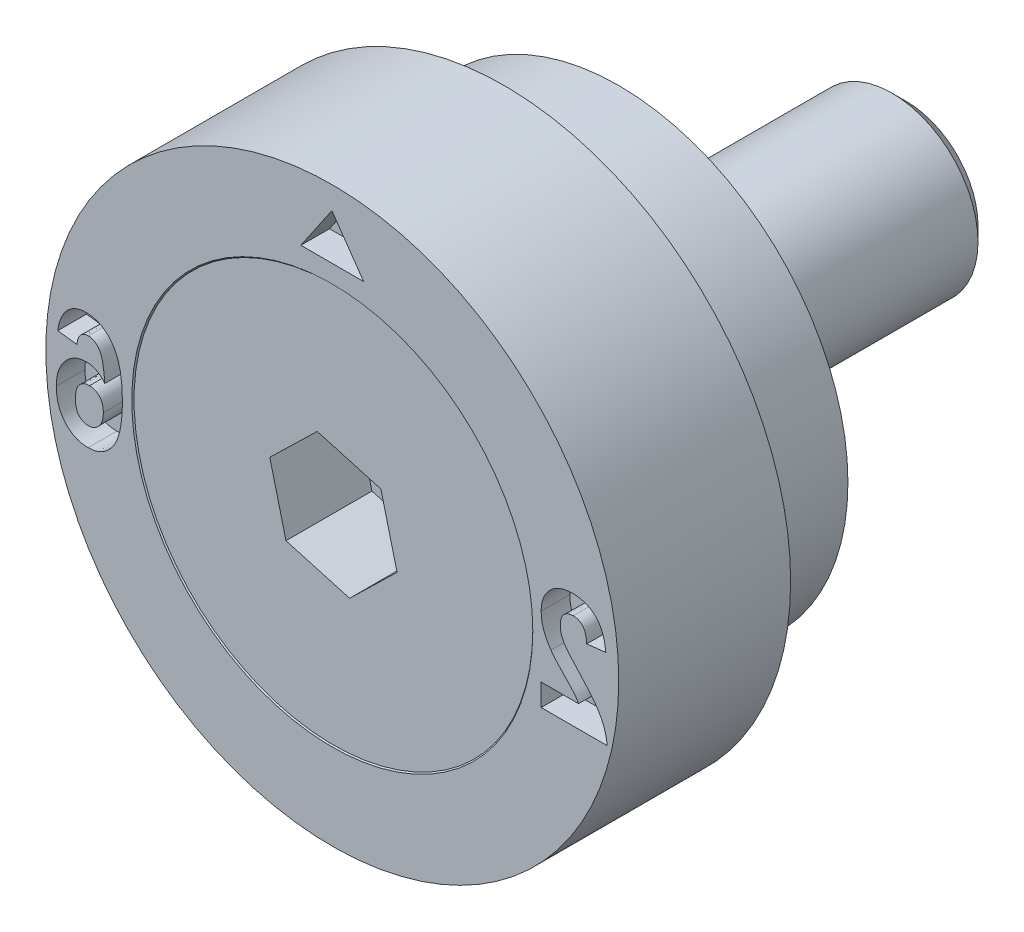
ISO-10303-21;
HEADER;
FILE_DESCRIPTION(('STEP AP214'),'2;1');
FILE_NAME('part.step','',(''),(''),'','','');
FILE_SCHEMA(('AUTOMOTIVE_DESIGN { 1 0 10303 214 1 1 1 1 }'));
ENDSEC;
DATA;
#1=APPLICATION_CONTEXT('core data for automotive mechanical design processes');
#2=APPLICATION_PROTOCOL_DEFINITION('international standard','automotive_design',2000,#1);
#3=PRODUCT_CONTEXT('',#1,'mechanical');
#4=PRODUCT('Part','Part','',(#3));
#5=PRODUCT_RELATED_PRODUCT_CATEGORY('part','',(#4));
#6=PRODUCT_DEFINITION_FORMATION('','',#4);
#7=PRODUCT_DEFINITION_CONTEXT('part definition',#1,'design');
#8=PRODUCT_DEFINITION('design','',#6,#7);
#9=PRODUCT_DEFINITION_SHAPE('','',#8);
#10=(LENGTH_UNIT() NAMED_UNIT(*) SI_UNIT(.MILLI.,.METRE.));
#11=(NAMED_UNIT(*) PLANE_ANGLE_UNIT() SI_UNIT($,.RADIAN.));
#12=(NAMED_UNIT(*) SI_UNIT($,.STERADIAN.) SOLID_ANGLE_UNIT());
#13=UNCERTAINTY_MEASURE_WITH_UNIT(LENGTH_MEASURE(1.E-05),#10,'distance_accuracy_value','');
#14=(GEOMETRIC_REPRESENTATION_CONTEXT(3) GLOBAL_UNCERTAINTY_ASSIGNED_CONTEXT((#13)) GLOBAL_UNIT_ASSIGNED_CONTEXT((#10,
#11,#12)) REPRESENTATION_CONTEXT('',''));
#15=CARTESIAN_POINT('',(0.,0.,0.));
#16=DIRECTION('',(0.,0.,1.));
#17=DIRECTION('',(1.,0.,0.));
#18=AXIS2_PLACEMENT_3D('',#15,#16,#17);
#19=CARTESIAN_POINT('',(0.,0.,-0.0200000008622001));
#20=DIRECTION('',(0.,0.,1.));
#21=DIRECTION('',(1.,0.,0.));
#22=AXIS2_PLACEMENT_3D('',#19,#20,#21);
#23=CYLINDRICAL_SURFACE('',#22,1.5);
#24=CARTESIAN_POINT('',(0.,0.,-2.0000000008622));
#25=DIRECTION('',(0.,0.,1.));
#26=DIRECTION('',(1.,0.,0.));
#27=AXIS2_PLACEMENT_3D('',#24,#25,#26);
#28=CIRCLE('',#27,1.5);
#29=CARTESIAN_POINT('',(1.5,0.,-2.0000000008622));
#30=VERTEX_POINT('',#29);
#31=EDGE_CURVE('E12',#30,#30,#28,.T.);
#32=ORIENTED_EDGE('',*,*,#31,.F.);
#33=EDGE_LOOP('',(#32));
#34=FACE_BOUND('',#33,.T.);
#35=CARTESIAN_POINT('',(0.,0.,-9.7700000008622));
#36=DIRECTION('',(0.,0.,1.));
#37=DIRECTION('',(1.,0.,0.));
#38=AXIS2_PLACEMENT_3D('',#35,#36,#37);
#39=CIRCLE('',#38,1.5);
#40=CARTESIAN_POINT('',(1.5,0.,-9.7700000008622));
#41=VERTEX_POINT('',#40);
#42=EDGE_CURVE('E152',#41,#41,#39,.T.);
#43=ORIENTED_EDGE('',*,*,#42,.T.);
#44=EDGE_LOOP('',(#43));
#45=FACE_BOUND('',#44,.T.);
#46=ADVANCED_FACE('F51',(#34,#45),#23,.T.);
#47=CARTESIAN_POINT('',(0.,0.,-2.0000000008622));
#48=DIRECTION('',(0.,0.,1.));
#49=DIRECTION('',(1.,0.,0.));
#50=AXIS2_PLACEMENT_3D('',#47,#48,#49);
#51=CONICAL_SURFACE('',#50,1.5,0.785398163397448);
#52=CARTESIAN_POINT('',(0.,0.,-0.0200000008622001));
#53=DIRECTION('',(0.,0.,1.));
#54=DIRECTION('',(1.,0.,0.));
#55=AXIS2_PLACEMENT_3D('',#52,#53,#54);
#56=CIRCLE('',#55,3.48);
#57=CARTESIAN_POINT('',(3.48,0.,-0.0200000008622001));
#58=VERTEX_POINT('',#57);
#59=EDGE_CURVE('E58',#58,#58,#56,.T.);
#60=ORIENTED_EDGE('',*,*,#59,.F.);
#61=EDGE_LOOP('',(#60));
#62=FACE_BOUND('',#61,.T.);
#63=ORIENTED_EDGE('',*,*,#31,.T.);
#64=EDGE_LOOP('',(#63));
#65=FACE_BOUND('',#64,.T.);
#66=ADVANCED_FACE('F167',(#62,#65),#51,.T.);
#67=CARTESIAN_POINT('',(0.,3.48,-0.0200000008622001));
#68=DIRECTION('',(0.,0.,-1.));
#69=DIRECTION('',(-1.,0.,0.));
#70=AXIS2_PLACEMENT_3D('',#67,#68,#69);
#71=PLANE('',#70);
#72=DIRECTION('',(0.962144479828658,-0.272539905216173,0.));
#73=VECTOR('',#72,1.);
#74=CARTESIAN_POINT('',(-0.828034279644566,-0.804793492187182,-0.0200000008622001));
#75=LINE('',#74,#73);
#76=CARTESIAN_POINT('',(-0.828034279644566,-0.804793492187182,-0.0200000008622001));
#77=VERTEX_POINT('',#76);
#78=CARTESIAN_POINT('',(0.282954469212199,-1.11949546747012,-0.0200000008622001));
#79=VERTEX_POINT('',#78);
#80=EDGE_CURVE('E139',#77,#79,#75,.T.);
#81=ORIENTED_EDGE('',*,*,#80,.F.);
#82=DIRECTION('',(0.245045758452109,-0.969511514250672,0.));
#83=VECTOR('',#82,1.);
#84=CARTESIAN_POINT('',(-1.11098874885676,0.314701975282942,-0.0200000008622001));
#85=LINE('',#84,#83);
#86=CARTESIAN_POINT('',(-1.11098874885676,0.314701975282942,-0.0200000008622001));
#87=VERTEX_POINT('',#86);
#88=EDGE_CURVE('E65',#87,#77,#85,.T.);
#89=ORIENTED_EDGE('',*,*,#88,.F.);
#90=DIRECTION('',(-0.717098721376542,-0.696971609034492,0.));
#91=VECTOR('',#90,1.);
#92=CARTESIAN_POINT('',(-0.282954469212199,1.11949546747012,-0.0200000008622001));
#93=LINE('',#92,#91);
#94=CARTESIAN_POINT('',(-0.282954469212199,1.11949546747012,-0.0200000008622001));
#95=VERTEX_POINT('',#94);
#96=EDGE_CURVE('E148',#95,#87,#93,.T.);
#97=ORIENTED_EDGE('',*,*,#96,.F.);
#98=DIRECTION('',(-0.962144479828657,0.272539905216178,0.));
#99=VECTOR('',#98,1.);
#100=CARTESIAN_POINT('',(0.828034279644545,0.804793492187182,-0.0200000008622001));
#101=LINE('',#100,#99);
#102=CARTESIAN_POINT('',(0.828034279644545,0.804793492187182,-0.0200000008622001));
#103=VERTEX_POINT('',#102);
#104=EDGE_CURVE('E146',#103,#95,#101,.T.);
#105=ORIENTED_EDGE('',*,*,#104,.F.);
#106=DIRECTION('',(-0.245045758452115,0.96951151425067,0.));
#107=VECTOR('',#106,1.);
#108=CARTESIAN_POINT('',(1.11098874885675,-0.314701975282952,-0.0200000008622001));
#109=LINE('',#108,#107);
#110=CARTESIAN_POINT('',(1.11098874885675,-0.314701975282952,-0.0200000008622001));
#111=VERTEX_POINT('',#110);
#112=EDGE_CURVE('E113',#111,#103,#109,.T.);
#113=ORIENTED_EDGE('',*,*,#112,.F.);
#114=DIRECTION('',(0.717098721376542,0.696971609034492,0.));
#115=VECTOR('',#114,1.);
#116=CARTESIAN_POINT('',(0.282954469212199,-1.11949546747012,-0.0200000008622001));
#117=LINE('',#116,#115);
#118=EDGE_CURVE('E142',#79,#111,#117,.T.);
#119=ORIENTED_EDGE('',*,*,#118,.F.);
#120=EDGE_LOOP('',(#81,#89,#97,#105,#113,#119));
#121=FACE_BOUND('',#120,.T.);
#122=ORIENTED_EDGE('',*,*,#59,.T.);
#123=EDGE_LOOP('',(#122));
#124=FACE_BOUND('',#123,.T.);
#125=ADVANCED_FACE('F165',(#121,#124),#71,.F.);
#126=CARTESIAN_POINT('',(0.,0.,-10.0200000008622));
#127=DIRECTION('',(0.,0.,1.));
#128=DIRECTION('',(1.,0.,0.));
#129=AXIS2_PLACEMENT_3D('',#126,#127,#128);
#130=PLANE('',#129);
#131=CARTESIAN_POINT('',(0.,0.,-10.0200000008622));
#132=DIRECTION('',(0.,0.,1.));
#133=DIRECTION('',(1.,0.,0.));
#134=AXIS2_PLACEMENT_3D('',#131,#132,#133);
#135=CIRCLE('',#134,1.25);
#136=CARTESIAN_POINT('',(1.25,0.,-10.0200000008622));
#137=VERTEX_POINT('',#136);
#138=EDGE_CURVE('E160',#137,#137,#135,.T.);
#139=ORIENTED_EDGE('',*,*,#138,.F.);
#140=EDGE_LOOP('',(#139));
#141=FACE_BOUND('',#140,.T.);
#142=ADVANCED_FACE('F180',(#141),#130,.F.);
#143=CARTESIAN_POINT('',(0.,0.,-10.0200000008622));
#144=DIRECTION('',(0.,0.,1.));
#145=DIRECTION('',(1.,0.,0.));
#146=AXIS2_PLACEMENT_3D('',#143,#144,#145);
#147=CONICAL_SURFACE('',#146,1.25,0.78539816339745);
#148=ORIENTED_EDGE('',*,*,#42,.F.);
#149=EDGE_LOOP('',(#148));
#150=FACE_BOUND('',#149,.T.);
#151=ORIENTED_EDGE('',*,*,#138,.T.);
#152=EDGE_LOOP('',(#151));
#153=FACE_BOUND('',#152,.T.);
#154=ADVANCED_FACE('F176',(#150,#153),#147,.T.);
#155=CARTESIAN_POINT('',(-1.11098874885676,0.314701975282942,-1.5200000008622));
#156=DIRECTION('',(-0.969511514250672,-0.245045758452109,0.));
#157=DIRECTION('',(0.245045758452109,-0.969511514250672,0.));
#158=AXIS2_PLACEMENT_3D('',#155,#156,#157);
#159=PLANE('',#158);
#160=ORIENTED_EDGE('',*,*,#88,.T.);
#161=DIRECTION('',(0.,0.,1.));
#162=VECTOR('',#161,1.);
#163=CARTESIAN_POINT('',(-0.828034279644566,-0.804793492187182,-1.5200000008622));
#164=LINE('',#163,#162);
#165=CARTESIAN_POINT('',(-0.828034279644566,-0.804793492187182,-1.5200000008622));
#166=VERTEX_POINT('',#165);
#167=EDGE_CURVE('E95',#166,#77,#164,.T.);
#168=ORIENTED_EDGE('',*,*,#167,.F.);
#169=DIRECTION('',(0.245045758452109,-0.969511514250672,0.));
#170=VECTOR('',#169,1.);
#171=CARTESIAN_POINT('',(-1.11098874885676,0.314701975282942,-1.5200000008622));
#172=LINE('',#171,#170);
#173=CARTESIAN_POINT('',(-1.11098874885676,0.314701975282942,-1.5200000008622));
#174=VERTEX_POINT('',#173);
#175=EDGE_CURVE('E150',#174,#166,#172,.T.);
#176=ORIENTED_EDGE('',*,*,#175,.F.);
#177=DIRECTION('',(0.,0.,1.));
#178=VECTOR('',#177,1.);
#179=CARTESIAN_POINT('',(-1.11098874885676,0.314701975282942,-1.5200000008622));
#180=LINE('',#179,#178);
#181=EDGE_CURVE('E73',#174,#87,#180,.T.);
#182=ORIENTED_EDGE('',*,*,#181,.T.);
#183=EDGE_LOOP('',(#160,#168,#176,#182));
#184=FACE_BOUND('',#183,.T.);
#185=ADVANCED_FACE('F179',(#184),#159,.F.);
#186=CARTESIAN_POINT('',(-0.282954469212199,1.11949546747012,-1.5200000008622));
#187=DIRECTION('',(-0.696971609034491,0.717098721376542,0.));
#188=DIRECTION('',(-0.717098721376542,-0.696971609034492,0.));
#189=AXIS2_PLACEMENT_3D('',#186,#187,#188);
#190=PLANE('',#189);
#191=ORIENTED_EDGE('',*,*,#96,.T.);
#192=ORIENTED_EDGE('',*,*,#181,.F.);
#193=DIRECTION('',(-0.717098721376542,-0.696971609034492,0.));
#194=VECTOR('',#193,1.);
#195=CARTESIAN_POINT('',(-0.282954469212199,1.11949546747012,-1.5200000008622));
#196=LINE('',#195,#194);
#197=CARTESIAN_POINT('',(-0.282954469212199,1.11949546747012,-1.5200000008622));
#198=VERTEX_POINT('',#197);
#199=EDGE_CURVE('E125',#198,#174,#196,.T.);
#200=ORIENTED_EDGE('',*,*,#199,.F.);
#201=DIRECTION('',(0.,0.,1.));
#202=VECTOR('',#201,1.);
#203=CARTESIAN_POINT('',(-0.282954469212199,1.11949546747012,-1.5200000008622));
#204=LINE('',#203,#202);
#205=EDGE_CURVE('E117',#198,#95,#204,.T.);
#206=ORIENTED_EDGE('',*,*,#205,.T.);
#207=EDGE_LOOP('',(#191,#192,#200,#206));
#208=FACE_BOUND('',#207,.T.);
#209=ADVANCED_FACE('F194',(#208),#190,.F.);
#210=CARTESIAN_POINT('',(0.828034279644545,0.804793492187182,-1.5200000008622));
#211=DIRECTION('',(0.272539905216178,0.962144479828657,0.));
#212=DIRECTION('',(-0.962144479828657,0.272539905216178,0.));
#213=AXIS2_PLACEMENT_3D('',#210,#211,#212);
#214=PLANE('',#213);
#215=ORIENTED_EDGE('',*,*,#104,.T.);
#216=ORIENTED_EDGE('',*,*,#205,.F.);
#217=DIRECTION('',(-0.962144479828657,0.272539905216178,0.));
#218=VECTOR('',#217,1.);
#219=CARTESIAN_POINT('',(0.828034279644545,0.804793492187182,-1.5200000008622));
#220=LINE('',#219,#218);
#221=CARTESIAN_POINT('',(0.828034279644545,0.804793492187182,-1.5200000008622));
#222=VERTEX_POINT('',#221);
#223=EDGE_CURVE('E121',#222,#198,#220,.T.);
#224=ORIENTED_EDGE('',*,*,#223,.F.);
#225=DIRECTION('',(0.,0.,1.));
#226=VECTOR('',#225,1.);
#227=CARTESIAN_POINT('',(0.828034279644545,0.804793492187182,-1.5200000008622));
#228=LINE('',#227,#226);
#229=EDGE_CURVE('E106',#222,#103,#228,.T.);
#230=ORIENTED_EDGE('',*,*,#229,.T.);
#231=EDGE_LOOP('',(#215,#216,#224,#230));
#232=FACE_BOUND('',#231,.T.);
#233=ADVANCED_FACE('F122',(#232),#214,.F.);
#234=CARTESIAN_POINT('',(1.11098874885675,-0.314701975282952,-1.5200000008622));
#235=DIRECTION('',(0.96951151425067,0.245045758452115,0.));
#236=DIRECTION('',(-0.245045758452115,0.96951151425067,0.));
#237=AXIS2_PLACEMENT_3D('',#234,#235,#236);
#238=PLANE('',#237);
#239=ORIENTED_EDGE('',*,*,#112,.T.);
#240=ORIENTED_EDGE('',*,*,#229,.F.);
#241=DIRECTION('',(-0.245045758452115,0.96951151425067,0.));
#242=VECTOR('',#241,1.);
#243=CARTESIAN_POINT('',(1.11098874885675,-0.314701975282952,-1.5200000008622));
#244=LINE('',#243,#242);
#245=CARTESIAN_POINT('',(1.11098874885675,-0.314701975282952,-1.5200000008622));
#246=VERTEX_POINT('',#245);
#247=EDGE_CURVE('E110',#246,#222,#244,.T.);
#248=ORIENTED_EDGE('',*,*,#247,.F.);
#249=DIRECTION('',(0.,0.,1.));
#250=VECTOR('',#249,1.);
#251=CARTESIAN_POINT('',(1.11098874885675,-0.314701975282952,-1.5200000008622));
#252=LINE('',#251,#250);
#253=EDGE_CURVE('E118',#246,#111,#252,.T.);
#254=ORIENTED_EDGE('',*,*,#253,.T.);
#255=EDGE_LOOP('',(#239,#240,#248,#254));
#256=FACE_BOUND('',#255,.T.);
#257=ADVANCED_FACE('F108',(#256),#238,.F.);
#258=CARTESIAN_POINT('',(0.282954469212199,-1.11949546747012,-1.5200000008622));
#259=DIRECTION('',(0.696971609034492,-0.717098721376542,0.));
#260=DIRECTION('',(0.717098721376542,0.696971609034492,0.));
#261=AXIS2_PLACEMENT_3D('',#258,#259,#260);
#262=PLANE('',#261);
#263=ORIENTED_EDGE('',*,*,#118,.T.);
#264=ORIENTED_EDGE('',*,*,#253,.F.);
#265=DIRECTION('',(0.717098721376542,0.696971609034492,0.));
#266=VECTOR('',#265,1.);
#267=CARTESIAN_POINT('',(0.282954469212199,-1.11949546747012,-1.5200000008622));
#268=LINE('',#267,#266);
#269=CARTESIAN_POINT('',(0.282954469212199,-1.11949546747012,-1.5200000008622));
#270=VERTEX_POINT('',#269);
#271=EDGE_CURVE('E131',#270,#246,#268,.T.);
#272=ORIENTED_EDGE('',*,*,#271,.F.);
#273=DIRECTION('',(0.,0.,1.));
#274=VECTOR('',#273,1.);
#275=CARTESIAN_POINT('',(0.282954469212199,-1.11949546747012,-1.5200000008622));
#276=LINE('',#275,#274);
#277=EDGE_CURVE('E155',#270,#79,#276,.T.);
#278=ORIENTED_EDGE('',*,*,#277,.T.);
#279=EDGE_LOOP('',(#263,#264,#272,#278));
#280=FACE_BOUND('',#279,.T.);
#281=ADVANCED_FACE('F198',(#280),#262,.F.);
#282=CARTESIAN_POINT('',(-0.828034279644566,-0.804793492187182,-1.5200000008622));
#283=DIRECTION('',(-0.272539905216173,-0.962144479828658,0.));
#284=DIRECTION('',(0.962144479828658,-0.272539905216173,0.));
#285=AXIS2_PLACEMENT_3D('',#282,#283,#284);
#286=PLANE('',#285);
#287=ORIENTED_EDGE('',*,*,#80,.T.);
#288=ORIENTED_EDGE('',*,*,#277,.F.);
#289=DIRECTION('',(0.962144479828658,-0.272539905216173,0.));
#290=VECTOR('',#289,1.);
#291=CARTESIAN_POINT('',(-0.828034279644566,-0.804793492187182,-1.5200000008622));
#292=LINE('',#291,#290);
#293=EDGE_CURVE('E133',#166,#270,#292,.T.);
#294=ORIENTED_EDGE('',*,*,#293,.F.);
#295=ORIENTED_EDGE('',*,*,#167,.T.);
#296=EDGE_LOOP('',(#287,#288,#294,#295));
#297=FACE_BOUND('',#296,.T.);
#298=ADVANCED_FACE('F195',(#297),#286,.F.);
#299=CARTESIAN_POINT('',(0.,0.,-1.5200000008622));
#300=DIRECTION('',(0.,0.,1.));
#301=DIRECTION('',(1.,0.,0.));
#302=AXIS2_PLACEMENT_3D('',#299,#300,#301);
#303=PLANE('',#302);
#304=ORIENTED_EDGE('',*,*,#175,.T.);
#305=ORIENTED_EDGE('',*,*,#293,.T.);
#306=ORIENTED_EDGE('',*,*,#271,.T.);
#307=ORIENTED_EDGE('',*,*,#247,.T.);
#308=ORIENTED_EDGE('',*,*,#223,.T.);
#309=ORIENTED_EDGE('',*,*,#199,.T.);
#310=EDGE_LOOP('',(#304,#305,#306,#307,#308,#309));
#311=FACE_BOUND('',#310,.T.);
#312=ADVANCED_FACE('F128',(#311),#303,.T.);
#313=CLOSED_SHELL('',(#46,#66,#125,#142,#154,#185,#209,#233,#257,#281,#298,#312));
#314=MANIFOLD_SOLID_BREP('B2',#313);
#315=CARTESIAN_POINT('',(0.,5.,0.));
#316=DIRECTION('',(0.,0.,-1.));
#317=DIRECTION('',(-1.,0.,0.));
#318=AXIS2_PLACEMENT_3D('',#315,#316,#317);
#319=PLANE('',#318);
#320=DIRECTION('',(0.,-1.,0.));
#321=VECTOR('',#320,1.);
#322=CARTESIAN_POINT('',(3.64578974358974,-0.694884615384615,0.));
#323=LINE('',#322,#321);
#324=CARTESIAN_POINT('',(3.64578974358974,-0.694884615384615,0.));
#325=VERTEX_POINT('',#324);
#326=CARTESIAN_POINT('',(3.64578974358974,-1.0795,0.));
#327=VERTEX_POINT('',#326);
#328=EDGE_CURVE('E694',#325,#327,#323,.T.);
#329=ORIENTED_EDGE('',*,*,#328,.F.);
#330=DIRECTION('',(-1.,0.,0.));
#331=VECTOR('',#330,1.);
#332=CARTESIAN_POINT('',(4.29923525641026,-0.694884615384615,0.));
#333=LINE('',#332,#331);
#334=CARTESIAN_POINT('',(4.29923525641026,-0.694884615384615,0.));
#335=VERTEX_POINT('',#334);
#336=EDGE_CURVE('E325',#335,#325,#333,.T.);
#337=ORIENTED_EDGE('',*,*,#336,.F.);
#338=CARTESIAN_POINT('',(3.81566153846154,-0.125173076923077,0.));
#339=CARTESIAN_POINT('',(3.82091886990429,-0.132847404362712,0.));
#340=CARTESIAN_POINT('',(3.83220192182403,-0.149317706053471,0.));
#341=CARTESIAN_POINT('',(3.85205715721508,-0.17421227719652,0.));
#342=CARTESIAN_POINT('',(3.8744361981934,-0.202014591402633,0.));
#343=CARTESIAN_POINT('',(3.90014076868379,-0.232028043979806,0.));
#344=CARTESIAN_POINT('',(3.92905633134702,-0.264301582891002,0.));
#345=CARTESIAN_POINT('',(3.96053053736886,-0.299443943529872,0.));
#346=CARTESIAN_POINT('',(3.99616295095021,-0.33596917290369,0.));
#347=CARTESIAN_POINT('',(4.03290284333,-0.374801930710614,0.));
#348=CARTESIAN_POINT('',(4.07025825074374,-0.412253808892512,0.));
#349=CARTESIAN_POINT('',(4.1041164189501,-0.448096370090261,0.));
#350=CARTESIAN_POINT('',(4.13475565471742,-0.480101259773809,0.));
#351=CARTESIAN_POINT('',(4.16148576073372,-0.508922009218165,0.));
#352=CARTESIAN_POINT('',(4.18469884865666,-0.534183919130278,0.));
#353=CARTESIAN_POINT('',(4.20450316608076,-0.555682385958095,0.));
#354=CARTESIAN_POINT('',(4.22021600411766,-0.574175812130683,0.));
#355=CARTESIAN_POINT('',(4.24238770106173,-0.602402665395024,0.));
#356=CARTESIAN_POINT('',(4.27029425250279,-0.641165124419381,0.));
#357=CARTESIAN_POINT('',(4.28983877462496,-0.677443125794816,0.));
#358=CARTESIAN_POINT('',(4.29923525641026,-0.694884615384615,0.));
#359=B_SPLINE_CURVE_WITH_KNOTS('',3,(#338,#339,#340,#341,#342,#343,#344,#345,#346,#347,#348,
#349,#350,#351,#352,#353,#354,#355,#356,#357,#358),.UNSPECIFIED.,.F.,.F.,(4,1,1,1,1,1,1,1,1,1,1,
1,1,1,1,1,1,1,4),(0.,0.0372293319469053,0.079899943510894,0.127410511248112,0.180123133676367,
0.238064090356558,0.30089248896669,0.368957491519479,0.442313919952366,0.514902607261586,
0.580699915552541,0.639694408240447,0.692276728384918,0.73805927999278,0.777043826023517,
0.809286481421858,0.835170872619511,0.920754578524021,1.),.UNSPECIFIED.);
#360=CARTESIAN_POINT('',(3.81566153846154,-0.125173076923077,0.));
#361=VERTEX_POINT('',#360);
#362=EDGE_CURVE('E522',#361,#335,#359,.T.);
#363=ORIENTED_EDGE('',*,*,#362,.F.);
#364=CARTESIAN_POINT('',(3.64578974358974,0.376429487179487,0.));
#365=CARTESIAN_POINT('',(3.64621245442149,0.354638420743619,0.));
#366=CARTESIAN_POINT('',(3.64705015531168,0.311454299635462,0.));
#367=CARTESIAN_POINT('',(3.65494215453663,0.247527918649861,0.));
#368=CARTESIAN_POINT('',(3.66766685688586,0.185179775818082,0.));
#369=CARTESIAN_POINT('',(3.68609868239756,0.124042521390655,0.));
#370=CARTESIAN_POINT('',(3.70952430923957,0.0629087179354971,0.));
#371=CARTESIAN_POINT('',(3.7391619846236,0.00107661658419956,0.));
#372=CARTESIAN_POINT('',(3.77429810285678,-0.0623403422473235,0.));
#373=CARTESIAN_POINT('',(3.80162214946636,-0.103846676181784,0.));
#374=CARTESIAN_POINT('',(3.81566153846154,-0.125173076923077,0.));
#375=B_SPLINE_CURVE_WITH_KNOTS('',3,(#364,#365,#366,#367,#368,#369,#370,#371,#372,#373,#374),
.UNSPECIFIED.,.F.,.F.,(4,1,1,1,1,1,1,1,4),(0.,0.121430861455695,0.240643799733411,
0.358470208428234,0.475770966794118,0.596193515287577,0.723070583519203,0.85771068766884,1.),.UNSPECIFIED.);
#376=CARTESIAN_POINT('',(3.64578974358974,0.376429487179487,0.));
#377=VERTEX_POINT('',#376);
#378=EDGE_CURVE('E525',#377,#361,#375,.T.);
#379=ORIENTED_EDGE('',*,*,#378,.F.);
#380=CARTESIAN_POINT('',(4.19667115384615,0.9205,0.));
#381=CARTESIAN_POINT('',(4.17581907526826,0.920051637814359,0.));
#382=CARTESIAN_POINT('',(4.13518578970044,0.919177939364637,0.));
#383=CARTESIAN_POINT('',(4.07584387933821,0.911992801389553,0.));
#384=CARTESIAN_POINT('',(4.02003299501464,0.899340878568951,0.));
#385=CARTESIAN_POINT('',(3.96726601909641,0.882960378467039,0.));
#386=CARTESIAN_POINT('',(3.91839562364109,0.860482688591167,0.));
#387=CARTESIAN_POINT('',(3.87268241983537,0.833610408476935,0.));
#388=CARTESIAN_POINT('',(3.8306551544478,0.8013846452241,0.));
#389=CARTESIAN_POINT('',(3.7921920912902,0.76491912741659,0.));
#390=CARTESIAN_POINT('',(3.75792408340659,0.724880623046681,0.));
#391=CARTESIAN_POINT('',(3.72764558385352,0.682365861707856,0.));
#392=CARTESIAN_POINT('',(3.70225492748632,0.637244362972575,0.));
#393=CARTESIAN_POINT('',(3.68180020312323,0.589637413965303,0.));
#394=CARTESIAN_POINT('',(3.66574316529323,0.53972788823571,0.));
#395=CARTESIAN_POINT('',(3.65406868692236,0.48745142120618,0.));
#396=CARTESIAN_POINT('',(3.64722057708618,0.432701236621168,0.));
#397=CARTESIAN_POINT('',(3.64627242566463,0.395412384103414,0.));
#398=CARTESIAN_POINT('',(3.64578974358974,0.376429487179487,0.));
#399=B_SPLINE_CURVE_WITH_KNOTS('',3,(#380,#381,#382,#383,#384,#385,#386,#387,#388,#389,#390,
#391,#392,#393,#394,#395,#396,#397,#398),.UNSPECIFIED.,.F.,.F.,(4,1,1,1,1,1,1,1,1,1,1,1,1,1,1,1,
4),(0.,0.0718026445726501,0.139917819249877,0.205419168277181,0.268691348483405,
0.329822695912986,0.390243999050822,0.450956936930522,0.511795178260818,0.572457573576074,
0.632179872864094,0.69128264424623,0.750406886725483,0.810332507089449,0.871593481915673,
0.934631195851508,1.),.UNSPECIFIED.);
#400=CARTESIAN_POINT('',(4.19667115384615,0.9205,0.));
#401=VERTEX_POINT('',#400);
#402=EDGE_CURVE('E1334',#401,#377,#399,.T.);
#403=ORIENTED_EDGE('',*,*,#402,.F.);
#404=CARTESIAN_POINT('',(4.77399487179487,0.317134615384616,0.));
#405=CARTESIAN_POINT('',(4.77131775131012,0.343098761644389,0.));
#406=CARTESIAN_POINT('',(4.76613036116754,0.393408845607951,0.));
#407=CARTESIAN_POINT('',(4.75213725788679,0.465592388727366,0.));
#408=CARTESIAN_POINT('',(4.73533746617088,0.532301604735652,0.));
#409=CARTESIAN_POINT('',(4.7139375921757,0.593271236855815,0.));
#410=CARTESIAN_POINT('',(4.68897145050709,0.648742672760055,0.));
#411=CARTESIAN_POINT('',(4.65961943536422,0.698290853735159,0.));
#412=CARTESIAN_POINT('',(4.62648435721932,0.742308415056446,0.));
#413=CARTESIAN_POINT('',(4.58907375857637,0.780409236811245,0.));
#414=CARTESIAN_POINT('',(4.54814862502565,0.813171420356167,0.));
#415=CARTESIAN_POINT('',(4.5053864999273,0.842328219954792,0.));
#416=CARTESIAN_POINT('',(4.45974864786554,0.866424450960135,0.));
#417=CARTESIAN_POINT('',(4.41177480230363,0.885993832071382,0.));
#418=CARTESIAN_POINT('',(4.36161481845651,0.901930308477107,0.));
#419=CARTESIAN_POINT('',(4.30865203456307,0.912378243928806,0.));
#420=CARTESIAN_POINT('',(4.253495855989,0.919617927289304,0.));
#421=CARTESIAN_POINT('',(4.21579287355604,0.920203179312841,0.));
#422=CARTESIAN_POINT('',(4.19667115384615,0.9205,0.));
#423=B_SPLINE_CURVE_WITH_KNOTS('',3,(#404,#405,#406,#407,#408,#409,#410,#411,#412,#413,#414,
#415,#416,#417,#418,#419,#420,#421,#422),.UNSPECIFIED.,.F.,.F.,(4,1,1,1,1,1,1,1,1,1,1,1,1,1,1,1,
4),(0.,0.0836347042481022,0.16205689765,0.235468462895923,0.303979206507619,0.368923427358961,
0.430156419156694,0.488208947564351,0.545123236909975,0.60081849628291,0.65603122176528,
0.710804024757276,0.765898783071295,0.821956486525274,0.879217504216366,0.938743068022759,1.),.UNSPECIFIED.);
#424=CARTESIAN_POINT('',(4.77399487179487,0.317134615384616,0.));
#425=VERTEX_POINT('',#424);
#426=EDGE_CURVE('E1329',#425,#401,#423,.T.);
#427=ORIENTED_EDGE('',*,*,#426,.F.);
#428=DIRECTION('',(0.993678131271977,0.112266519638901,0.));
#429=VECTOR('',#428,1.);
#430=CARTESIAN_POINT('',(4.44066153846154,0.279474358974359,0.));
#431=LINE('',#430,#429);
#432=CARTESIAN_POINT('',(4.44066153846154,0.279474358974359,0.));
#433=VERTEX_POINT('',#432);
#434=EDGE_CURVE('E1323',#433,#425,#431,.T.);
#435=ORIENTED_EDGE('',*,*,#434,.F.);
#436=CARTESIAN_POINT('',(4.20388269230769,0.587166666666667,0.));
#437=CARTESIAN_POINT('',(4.22040159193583,0.586388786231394,0.));
#438=CARTESIAN_POINT('',(4.25228264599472,0.584887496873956,0.));
#439=CARTESIAN_POINT('',(4.29762478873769,0.571328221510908,0.));
#440=CARTESIAN_POINT('',(4.33735542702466,0.548245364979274,0.));
#441=CARTESIAN_POINT('',(4.36575604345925,0.522033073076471,0.));
#442=CARTESIAN_POINT('',(4.3848646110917,0.496493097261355,0.));
#443=CARTESIAN_POINT('',(4.3976765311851,0.474079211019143,0.));
#444=CARTESIAN_POINT('',(4.40934463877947,0.448970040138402,0.));
#445=CARTESIAN_POINT('',(4.41877140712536,0.420683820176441,0.));
#446=CARTESIAN_POINT('',(4.42683056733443,0.389634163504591,0.));
#447=CARTESIAN_POINT('',(4.43308114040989,0.355614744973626,0.));
#448=CARTESIAN_POINT('',(4.43795310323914,0.318574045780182,0.));
#449=CARTESIAN_POINT('',(4.43973552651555,0.292842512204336,0.));
#450=CARTESIAN_POINT('',(4.44066153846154,0.279474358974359,0.));
#451=B_SPLINE_CURVE_WITH_KNOTS('',3,(#436,#437,#438,#439,#440,#441,#442,#443,#444,#445,#446,
#447,#448,#449,#450),.UNSPECIFIED.,.F.,.F.,(4,1,1,1,1,1,1,1,1,1,1,1,4),(0.,0.113180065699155,
0.218434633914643,0.321087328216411,0.426146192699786,0.481136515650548,0.539455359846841,
0.603018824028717,0.670840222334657,0.743752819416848,0.823023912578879,0.908056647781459,1.),.UNSPECIFIED.);
#452=CARTESIAN_POINT('',(4.20388269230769,0.587166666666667,0.));
#453=VERTEX_POINT('',#452);
#454=EDGE_CURVE('E1303',#453,#433,#451,.T.);
#455=ORIENTED_EDGE('',*,*,#454,.F.);
#456=CARTESIAN_POINT('',(3.97912307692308,0.324746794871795,0.));
#457=CARTESIAN_POINT('',(3.97969358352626,0.344703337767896,0.));
#458=CARTESIAN_POINT('',(3.98077233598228,0.382438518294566,0.));
#459=CARTESIAN_POINT('',(3.99200245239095,0.435521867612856,0.));
#460=CARTESIAN_POINT('',(4.01087480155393,0.481294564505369,0.));
#461=CARTESIAN_POINT('',(4.03708472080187,0.519910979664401,0.));
#462=CARTESIAN_POINT('',(4.07067009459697,0.54980786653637,0.));
#463=CARTESIAN_POINT('',(4.10967671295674,0.572501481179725,0.));
#464=CARTESIAN_POINT('',(4.1552446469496,0.584615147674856,0.));
#465=CARTESIAN_POINT('',(4.1872587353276,0.586294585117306,0.));
#466=CARTESIAN_POINT('',(4.20388269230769,0.587166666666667,0.));
#467=B_SPLINE_CURVE_WITH_KNOTS('',3,(#456,#457,#458,#459,#460,#461,#462,#463,#464,#465,#466),
.UNSPECIFIED.,.F.,.F.,(4,1,1,1,1,1,1,1,4),(0.,0.152713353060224,0.288760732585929,
0.413023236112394,0.52994305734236,0.642943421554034,0.754737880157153,0.872642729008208,1.),.UNSPECIFIED.);
#468=CARTESIAN_POINT('',(3.97912307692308,0.324746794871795,0.));
#469=VERTEX_POINT('',#468);
#470=EDGE_CURVE('E1301',#469,#453,#467,.T.);
#471=ORIENTED_EDGE('',*,*,#470,.F.);
#472=CARTESIAN_POINT('',(4.04683141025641,0.0935769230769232,0.));
#473=CARTESIAN_POINT('',(4.03647064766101,0.112850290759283,0.));
#474=CARTESIAN_POINT('',(4.01639721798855,0.150191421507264,0.));
#475=CARTESIAN_POINT('',(3.99488777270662,0.208579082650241,0.));
#476=CARTESIAN_POINT('',(3.98195765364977,0.266752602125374,0.));
#477=CARTESIAN_POINT('',(3.98005949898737,0.30558801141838,0.));
#478=CARTESIAN_POINT('',(3.97912307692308,0.324746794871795,0.));
#479=B_SPLINE_CURVE_WITH_KNOTS('',3,(#472,#473,#474,#475,#476,#477,#478),.UNSPECIFIED.,.F.,.F.,
(4,1,1,1,4),(0.,0.269282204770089,0.52172003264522,0.764048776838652,1.),.UNSPECIFIED.);
#480=CARTESIAN_POINT('',(4.04683141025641,0.0935769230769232,0.));
#481=VERTEX_POINT('',#480);
#482=EDGE_CURVE('E1294',#481,#469,#479,.T.);
#483=ORIENTED_EDGE('',*,*,#482,.F.);
#484=CARTESIAN_POINT('',(4.31886666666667,-0.229339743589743,0.));
#485=CARTESIAN_POINT('',(4.3012107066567,-0.210268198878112,0.));
#486=CARTESIAN_POINT('',(4.2676263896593,-0.173991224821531,0.));
#487=CARTESIAN_POINT('',(4.22007436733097,-0.121763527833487,0.));
#488=CARTESIAN_POINT('',(4.1780980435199,-0.0741321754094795,0.));
#489=CARTESIAN_POINT('',(4.14131111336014,-0.0314438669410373,0.));
#490=CARTESIAN_POINT('',(4.10976600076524,0.00636764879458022,0.));
#491=CARTESIAN_POINT('',(4.08375243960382,0.0394290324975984,0.));
#492=CARTESIAN_POINT('',(4.06304816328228,0.0678334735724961,0.));
#493=CARTESIAN_POINT('',(4.05182784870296,0.0856452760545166,0.));
#494=CARTESIAN_POINT('',(4.04683141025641,0.0935769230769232,0.));
#495=B_SPLINE_CURVE_WITH_KNOTS('',3,(#484,#485,#486,#487,#488,#489,#490,#491,#492,#493,#494),
.UNSPECIFIED.,.F.,.F.,(4,1,1,1,1,1,1,1,4),(0.,0.184436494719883,0.350826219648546,
0.50123098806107,0.634967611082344,0.750729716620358,0.850641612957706,0.933490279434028,1.),.UNSPECIFIED.);
#496=CARTESIAN_POINT('',(4.31886666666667,-0.229339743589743,0.));
#497=VERTEX_POINT('',#496);
#498=EDGE_CURVE('E1286',#497,#481,#495,.T.);
#499=ORIENTED_EDGE('',*,*,#498,.F.);
#500=CARTESIAN_POINT('',(4.7996358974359,-1.0795,0.));
#501=CARTESIAN_POINT('',(4.79566653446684,-1.04665730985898,0.));
#502=CARTESIAN_POINT('',(4.78774886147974,-0.981146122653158,0.));
#503=CARTESIAN_POINT('',(4.76328976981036,-0.88523602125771,0.));
#504=CARTESIAN_POINT('',(4.73095650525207,-0.791575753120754,0.));
#505=CARTESIAN_POINT('',(4.69540984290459,-0.715449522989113,0.));
#506=CARTESIAN_POINT('',(4.66088844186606,-0.653533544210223,0.));
#507=CARTESIAN_POINT('',(4.62854439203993,-0.60362757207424,0.));
#508=CARTESIAN_POINT('',(4.59081496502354,-0.549939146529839,0.));
#509=CARTESIAN_POINT('',(4.54742576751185,-0.49268902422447,0.));
#510=CARTESIAN_POINT('',(4.49847546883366,-0.431813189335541,0.));
#511=CARTESIAN_POINT('',(4.44388626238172,-0.367368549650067,0.));
#512=CARTESIAN_POINT('',(4.38379499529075,-0.299105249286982,0.));
#513=CARTESIAN_POINT('',(4.34101685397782,-0.253140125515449,0.));
#514=CARTESIAN_POINT('',(4.31886666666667,-0.229339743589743,0.));
#515=B_SPLINE_CURVE_WITH_KNOTS('',3,(#500,#501,#502,#503,#504,#505,#506,#507,#508,#509,#510,
#511,#512,#513,#514),.UNSPECIFIED.,.F.,.F.,(4,1,1,1,1,1,1,1,1,1,1,1,4),(0.,0.0994452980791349,
0.198363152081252,0.297103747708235,0.397237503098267,0.450667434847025,0.510300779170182,
0.576071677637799,0.648078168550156,0.72639487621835,0.811079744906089,0.902178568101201,1.),.UNSPECIFIED.);
#516=CARTESIAN_POINT('',(4.7996358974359,-1.0795,0.));
#517=VERTEX_POINT('',#516);
#518=EDGE_CURVE('E1295',#517,#497,#515,.T.);
#519=ORIENTED_EDGE('',*,*,#518,.F.);
#520=DIRECTION('',(1.,0.,0.));
#521=VECTOR('',#520,1.);
#522=CARTESIAN_POINT('',(3.64578974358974,-1.0795,0.));
#523=LINE('',#522,#521);
#524=EDGE_CURVE('E1402',#327,#517,#523,.T.);
#525=ORIENTED_EDGE('',*,*,#524,.F.);
#526=EDGE_LOOP('',(#329,#337,#363,#379,#403,#427,#435,#455,#471,#483,#499,#519,#525));
#527=FACE_BOUND('',#526,.T.);
#528=DIRECTION('',(0.992130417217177,-0.125208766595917,0.));
#529=VECTOR('',#528,1.);
#530=CARTESIAN_POINT('',(-4.79113333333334,0.398464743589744,0.));
#531=LINE('',#530,#529);
#532=CARTESIAN_POINT('',(-4.79113333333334,0.398464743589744,0.));
#533=VERTEX_POINT('',#532);
#534=CARTESIAN_POINT('',(-4.45780000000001,0.356397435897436,0.));
#535=VERTEX_POINT('',#534);
#536=EDGE_CURVE('E699',#533,#535,#531,.T.);
#537=ORIENTED_EDGE('',*,*,#536,.F.);
#538=CARTESIAN_POINT('',(-4.29794423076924,0.9205,0.));
#539=CARTESIAN_POINT('',(-4.31412793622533,0.920174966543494,0.));
#540=CARTESIAN_POINT('',(-4.34582776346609,0.919538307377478,0.));
#541=CARTESIAN_POINT('',(-4.39234481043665,0.91275538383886,0.));
#542=CARTESIAN_POINT('',(-4.43677916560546,0.902509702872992,0.));
#543=CARTESIAN_POINT('',(-4.47918366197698,0.888117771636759,0.));
#544=CARTESIAN_POINT('',(-4.51919198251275,0.869075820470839,0.));
#545=CARTESIAN_POINT('',(-4.55694788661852,0.845663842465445,0.));
#546=CARTESIAN_POINT('',(-4.59273306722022,0.818247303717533,0.));
#547=CARTESIAN_POINT('',(-4.6264773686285,0.787045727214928,0.));
#548=CARTESIAN_POINT('',(-4.65743490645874,0.751550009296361,0.));
#549=CARTESIAN_POINT('',(-4.68540886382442,0.712120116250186,0.));
#550=CARTESIAN_POINT('',(-4.71076547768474,0.66917118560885,0.));
#551=CARTESIAN_POINT('',(-4.73281090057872,0.622293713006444,0.));
#552=CARTESIAN_POINT('',(-4.75191211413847,0.571747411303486,0.));
#553=CARTESIAN_POINT('',(-4.7684463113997,0.517457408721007,0.));
#554=CARTESIAN_POINT('',(-4.78156469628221,0.45930121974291,0.));
#555=CARTESIAN_POINT('',(-4.78789210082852,0.41907218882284,0.));
#556=CARTESIAN_POINT('',(-4.79113333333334,0.398464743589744,0.));
#557=B_SPLINE_CURVE_WITH_KNOTS('',3,(#538,#539,#540,#541,#542,#543,#544,#545,#546,#547,#548,
#549,#550,#551,#552,#553,#554,#555,#556),.UNSPECIFIED.,.F.,.F.,(4,1,1,1,1,1,1,1,1,1,1,1,1,1,1,1,
4),(0.,0.0611751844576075,0.119826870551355,0.177416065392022,0.233487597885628,
0.288846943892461,0.344642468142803,0.401221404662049,0.459126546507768,0.518194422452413,
0.579030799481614,0.641754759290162,0.706604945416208,0.774715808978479,0.845986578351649,
0.921106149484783,1.),.UNSPECIFIED.);
#558=CARTESIAN_POINT('',(-4.29794423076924,0.9205,0.));
#559=VERTEX_POINT('',#558);
#560=EDGE_CURVE('E333',#559,#533,#557,.T.);
#561=ORIENTED_EDGE('',*,*,#560,.F.);
#562=CARTESIAN_POINT('',(-3.66292820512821,-0.106342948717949,0.));
#563=CARTESIAN_POINT('',(-3.66341620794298,-0.062523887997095,0.));
#564=CARTESIAN_POINT('',(-3.66435896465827,0.0221287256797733,0.));
#565=CARTESIAN_POINT('',(-3.67295979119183,0.144333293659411,0.));
#566=CARTESIAN_POINT('',(-3.6861503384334,0.2571615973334,0.));
#567=CARTESIAN_POINT('',(-3.70518542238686,0.360423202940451,0.));
#568=CARTESIAN_POINT('',(-3.72982113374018,0.454295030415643,0.));
#569=CARTESIAN_POINT('',(-3.76015747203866,0.538680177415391,0.));
#570=CARTESIAN_POINT('',(-3.7955217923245,0.613969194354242,0.));
#571=CARTESIAN_POINT('',(-3.8372492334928,0.679385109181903,0.));
#572=CARTESIAN_POINT('',(-3.88321399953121,0.736249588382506,0.));
#573=CARTESIAN_POINT('',(-3.93261333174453,0.78550484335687,0.));
#574=CARTESIAN_POINT('',(-3.98552749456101,0.827070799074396,0.));
#575=CARTESIAN_POINT('',(-4.04135996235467,0.861617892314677,0.));
#576=CARTESIAN_POINT('',(-4.10095161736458,0.887729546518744,0.));
#577=CARTESIAN_POINT('',(-4.16361453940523,0.906595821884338,0.));
#578=CARTESIAN_POINT('',(-4.22963418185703,0.918733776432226,0.));
#579=CARTESIAN_POINT('',(-4.27492063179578,0.919904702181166,0.));
#580=CARTESIAN_POINT('',(-4.29794423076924,0.9205,0.));
#581=B_SPLINE_CURVE_WITH_KNOTS('',3,(#562,#563,#564,#565,#566,#567,#568,#569,#570,#571,#572,
#573,#574,#575,#576,#577,#578,#579,#580),.UNSPECIFIED.,.F.,.F.,(4,1,1,1,1,1,1,1,1,1,1,1,1,1,1,1,
4),(0.,0.0968769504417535,0.187153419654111,0.270734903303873,0.347936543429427,
0.419133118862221,0.485079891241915,0.545967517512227,0.602654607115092,0.656196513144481,
0.707353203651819,0.756561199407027,0.804672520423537,0.852134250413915,0.899962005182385,
0.949140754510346,1.),.UNSPECIFIED.);
#582=CARTESIAN_POINT('',(-3.66292820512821,-0.106342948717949,0.));
#583=VERTEX_POINT('',#582);
#584=EDGE_CURVE('E629',#583,#559,#581,.T.);
#585=ORIENTED_EDGE('',*,*,#584,.F.);
#586=CARTESIAN_POINT('',(-4.2614858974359,-1.10514102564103,0.));
#587=CARTESIAN_POINT('',(-4.24007232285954,-1.10447198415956,0.));
#588=CARTESIAN_POINT('',(-4.1980300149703,-1.10315842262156,0.));
#589=CARTESIAN_POINT('',(-4.13645072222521,-1.09206797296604,0.));
#590=CARTESIAN_POINT('',(-4.07790890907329,-1.07352474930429,0.));
#591=CARTESIAN_POINT('',(-4.02233183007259,-1.04754843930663,0.));
#592=CARTESIAN_POINT('',(-3.96931105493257,-1.01500812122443,0.));
#593=CARTESIAN_POINT('',(-3.91970447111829,-0.974369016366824,0.));
#594=CARTESIAN_POINT('',(-3.87343420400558,-0.9262830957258,0.));
#595=CARTESIAN_POINT('',(-3.82911671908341,-0.871691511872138,0.));
#596=CARTESIAN_POINT('',(-3.78967032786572,-0.807957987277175,0.));
#597=CARTESIAN_POINT('',(-3.75528595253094,-0.73513972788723,0.));
#598=CARTESIAN_POINT('',(-3.72674458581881,-0.652839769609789,0.));
#599=CARTESIAN_POINT('',(-3.70322164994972,-0.561437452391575,0.));
#600=CARTESIAN_POINT('',(-3.68511626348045,-0.460717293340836,0.));
#601=CARTESIAN_POINT('',(-3.67199562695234,-0.350760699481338,0.));
#602=CARTESIAN_POINT('',(-3.66462377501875,-0.231577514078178,0.));
#603=CARTESIAN_POINT('',(-3.66350693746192,-0.149088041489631,0.));
#604=CARTESIAN_POINT('',(-3.66292820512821,-0.106342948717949,0.));
#605=B_SPLINE_CURVE_WITH_KNOTS('',3,(#586,#587,#588,#589,#590,#591,#592,#593,#594,#595,#596,
#597,#598,#599,#600,#601,#602,#603,#604),.UNSPECIFIED.,.F.,.F.,(4,1,1,1,1,1,1,1,1,1,1,1,1,1,1,1,
4),(0.,0.0492015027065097,0.096599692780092,0.143304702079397,0.190008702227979,
0.23729638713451,0.285966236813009,0.336988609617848,0.390499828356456,0.447322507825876,
0.508847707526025,0.575267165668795,0.647277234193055,0.725623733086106,0.810356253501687,
0.901728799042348,1.),.UNSPECIFIED.);
#606=CARTESIAN_POINT('',(-4.2614858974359,-1.10514102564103,0.));
#607=VERTEX_POINT('',#606);
#608=EDGE_CURVE('E785',#607,#583,#605,.T.);
#609=ORIENTED_EDGE('',*,*,#608,.F.);
#610=CARTESIAN_POINT('',(-4.81677435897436,-0.452897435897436,0.));
#611=CARTESIAN_POINT('',(-4.81632893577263,-0.476952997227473,0.));
#612=CARTESIAN_POINT('',(-4.81546071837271,-0.523842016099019,0.));
#613=CARTESIAN_POINT('',(-4.80822270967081,-0.592475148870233,0.));
#614=CARTESIAN_POINT('',(-4.79574264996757,-0.657260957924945,0.));
#615=CARTESIAN_POINT('',(-4.77904865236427,-0.718789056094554,0.));
#616=CARTESIAN_POINT('',(-4.75702452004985,-0.77648938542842,0.));
#617=CARTESIAN_POINT('',(-4.73002970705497,-0.830562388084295,0.));
#618=CARTESIAN_POINT('',(-4.69824341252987,-0.880916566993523,0.));
#619=CARTESIAN_POINT('',(-4.66193182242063,-0.927173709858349,0.));
#620=CARTESIAN_POINT('',(-4.62183467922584,-0.968954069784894,0.));
#621=CARTESIAN_POINT('',(-4.57869720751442,-1.00552103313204,0.));
#622=CARTESIAN_POINT('',(-4.53245685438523,-1.0361720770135,0.));
#623=CARTESIAN_POINT('',(-4.48389999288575,-1.06179099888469,0.));
#624=CARTESIAN_POINT('',(-4.43206894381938,-1.08088252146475,0.));
#625=CARTESIAN_POINT('',(-4.37775120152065,-1.09500565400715,0.));
#626=CARTESIAN_POINT('',(-4.32051960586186,-1.10360404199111,0.));
#627=CARTESIAN_POINT('',(-4.28141407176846,-1.10462218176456,0.));
#628=CARTESIAN_POINT('',(-4.2614858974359,-1.10514102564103,0.));
#629=B_SPLINE_CURVE_WITH_KNOTS('',3,(#610,#611,#612,#613,#614,#615,#616,#617,#618,#619,#620,
#621,#622,#623,#624,#625,#626,#627,#628),.UNSPECIFIED.,.F.,.F.,(4,1,1,1,1,1,1,1,1,1,1,1,1,1,1,1,
4),(0.,0.0750177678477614,0.146224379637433,0.214927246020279,0.280612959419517,
0.344820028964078,0.407223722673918,0.468817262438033,0.530228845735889,0.590325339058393,
0.649151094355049,0.706220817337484,0.763043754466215,0.819985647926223,0.878076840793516,
0.937867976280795,1.),.UNSPECIFIED.);
#630=CARTESIAN_POINT('',(-4.81677435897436,-0.452897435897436,0.));
#631=VERTEX_POINT('',#630);
#632=EDGE_CURVE('E793',#631,#607,#629,.T.);
#633=ORIENTED_EDGE('',*,*,#632,.F.);
#634=CARTESIAN_POINT('',(-4.29193461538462,0.176910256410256,0.));
#635=CARTESIAN_POINT('',(-4.3097240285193,0.176349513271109,0.));
#636=CARTESIAN_POINT('',(-4.34468590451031,0.175247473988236,0.));
#637=CARTESIAN_POINT('',(-4.39625197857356,0.167154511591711,0.));
#638=CARTESIAN_POINT('',(-4.44561585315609,0.152944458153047,0.));
#639=CARTESIAN_POINT('',(-4.49316827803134,0.133615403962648,0.));
#640=CARTESIAN_POINT('',(-4.53897768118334,0.108966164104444,0.));
#641=CARTESIAN_POINT('',(-4.58252259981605,0.0784180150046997,0.));
#642=CARTESIAN_POINT('',(-4.62408084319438,0.0422692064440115,0.));
#643=CARTESIAN_POINT('',(-4.66345804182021,0.00142142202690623,0.));
#644=CARTESIAN_POINT('',(-4.69923552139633,-0.0439736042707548,0.));
#645=CARTESIAN_POINT('',(-4.73077738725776,-0.0929232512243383,0.));
#646=CARTESIAN_POINT('',(-4.75776626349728,-0.145001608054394,0.));
#647=CARTESIAN_POINT('',(-4.77924674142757,-0.200571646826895,0.));
#648=CARTESIAN_POINT('',(-4.79626894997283,-0.259132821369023,0.));
#649=CARTESIAN_POINT('',(-4.80804539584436,-0.320837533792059,0.));
#650=CARTESIAN_POINT('',(-4.81549730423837,-0.385807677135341,0.));
#651=CARTESIAN_POINT('',(-4.81634180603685,-0.43017337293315,0.));
#652=CARTESIAN_POINT('',(-4.81677435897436,-0.452897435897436,0.));
#653=B_SPLINE_CURVE_WITH_KNOTS('',3,(#634,#635,#636,#637,#638,#639,#640,#641,#642,#643,#644,
#645,#646,#647,#648,#649,#650,#651,#652),.UNSPECIFIED.,.F.,.F.,(4,1,1,1,1,1,1,1,1,1,1,1,1,1,1,1,
4),(0.,0.0583907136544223,0.11475639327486,0.170822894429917,0.226672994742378,
0.282972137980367,0.341229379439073,0.400909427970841,0.463543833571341,0.527222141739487,
0.590338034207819,0.654457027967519,0.71942624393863,0.785610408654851,0.854396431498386,
0.925422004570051,1.),.UNSPECIFIED.);
#654=CARTESIAN_POINT('',(-4.29193461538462,0.176910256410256,0.));
#655=VERTEX_POINT('',#654);
#656=EDGE_CURVE('E801',#655,#631,#653,.T.);
#657=ORIENTED_EDGE('',*,*,#656,.F.);
#658=CARTESIAN_POINT('',(-3.97102115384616,0.00944230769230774,0.));
#659=CARTESIAN_POINT('',(-3.98183682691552,0.0227685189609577,0.));
#660=CARTESIAN_POINT('',(-4.00295636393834,0.0487903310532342,0.));
#661=CARTESIAN_POINT('',(-4.03849671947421,0.0830070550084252,0.));
#662=CARTESIAN_POINT('',(-4.07587201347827,0.111946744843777,0.));
#663=CARTESIAN_POINT('',(-4.11499149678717,0.136197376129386,0.));
#664=CARTESIAN_POINT('',(-4.15661992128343,0.153927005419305,0.));
#665=CARTESIAN_POINT('',(-4.19985857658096,0.167636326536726,0.));
#666=CARTESIAN_POINT('',(-4.24533760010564,0.175098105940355,0.));
#667=CARTESIAN_POINT('',(-4.27628554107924,0.176301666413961,0.));
#668=CARTESIAN_POINT('',(-4.29193461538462,0.176910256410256,0.));
#669=B_SPLINE_CURVE_WITH_KNOTS('',3,(#658,#659,#660,#661,#662,#663,#664,#665,#666,#667,#668),
.UNSPECIFIED.,.F.,.F.,(4,1,1,1,1,1,1,1,4),(0.,0.136900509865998,0.267322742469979,
0.392698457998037,0.513725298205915,0.63354429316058,0.752907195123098,0.875055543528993,1.),.UNSPECIFIED.);
#670=CARTESIAN_POINT('',(-3.97102115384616,0.00944230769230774,0.));
#671=VERTEX_POINT('',#670);
#672=EDGE_CURVE('E809',#671,#655,#669,.T.);
#673=ORIENTED_EDGE('',*,*,#672,.F.);
#674=CARTESIAN_POINT('',(-4.25627756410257,0.587166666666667,0.));
#675=CARTESIAN_POINT('',(-4.24716380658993,0.586930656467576,0.));
#676=CARTESIAN_POINT('',(-4.22902312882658,0.586460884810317,0.));
#677=CARTESIAN_POINT('',(-4.20265523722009,0.580499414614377,0.));
#678=CARTESIAN_POINT('',(-4.17728372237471,0.57164838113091,0.));
#679=CARTESIAN_POINT('',(-4.1530876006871,0.558997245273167,0.));
#680=CARTESIAN_POINT('',(-4.12974369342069,0.542928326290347,0.));
#681=CARTESIAN_POINT('',(-4.10777354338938,0.523069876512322,0.));
#682=CARTESIAN_POINT('',(-4.08664047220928,0.50000940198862,0.));
#683=CARTESIAN_POINT('',(-4.06680241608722,0.472675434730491,0.));
#684=CARTESIAN_POINT('',(-4.04786600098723,0.440078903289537,0.));
#685=CARTESIAN_POINT('',(-4.03181885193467,0.400184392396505,0.));
#686=CARTESIAN_POINT('',(-4.01697995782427,0.353197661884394,0.));
#687=CARTESIAN_POINT('',(-4.00472902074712,0.298541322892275,0.));
#688=CARTESIAN_POINT('',(-3.99278086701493,0.23690886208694,0.));
#689=CARTESIAN_POINT('',(-3.9840628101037,0.167684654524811,0.));
#690=CARTESIAN_POINT('',(-3.9763527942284,0.0911421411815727,0.));
#691=CARTESIAN_POINT('',(-3.97285226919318,0.0375015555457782,0.));
#692=CARTESIAN_POINT('',(-3.97102115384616,0.00944230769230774,0.));
#693=B_SPLINE_CURVE_WITH_KNOTS('',3,(#674,#675,#676,#677,#678,#679,#680,#681,#682,#683,#684,
#685,#686,#687,#688,#689,#690,#691,#692),.UNSPECIFIED.,.F.,.F.,(4,1,1,1,1,1,1,1,1,1,1,1,1,1,1,1,
4),(0.,0.0385532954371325,0.0767392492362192,0.113973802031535,0.152197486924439,
0.192074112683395,0.233765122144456,0.277433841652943,0.324413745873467,0.376643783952,
0.436768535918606,0.506220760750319,0.585296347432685,0.673989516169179,0.772204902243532,
0.880840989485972,1.),.UNSPECIFIED.);
#694=CARTESIAN_POINT('',(-4.25627756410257,0.587166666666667,0.));
#695=VERTEX_POINT('',#694);
#696=EDGE_CURVE('E817',#695,#671,#693,.T.);
#697=ORIENTED_EDGE('',*,*,#696,.F.);
#698=CARTESIAN_POINT('',(-4.45780000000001,0.356397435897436,0.));
#699=CARTESIAN_POINT('',(-4.45532667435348,0.374913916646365,0.));
#700=CARTESIAN_POINT('',(-4.45067988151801,0.409701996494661,0.));
#701=CARTESIAN_POINT('',(-4.43711844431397,0.457705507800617,0.));
#702=CARTESIAN_POINT('',(-4.41848502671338,0.498287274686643,0.));
#703=CARTESIAN_POINT('',(-4.39401727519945,0.530885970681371,0.));
#704=CARTESIAN_POINT('',(-4.36552660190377,0.556514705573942,0.));
#705=CARTESIAN_POINT('',(-4.33263476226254,0.574527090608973,0.));
#706=CARTESIAN_POINT('',(-4.29565868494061,0.585202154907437,0.));
#707=CARTESIAN_POINT('',(-4.26970432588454,0.586496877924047,0.));
#708=CARTESIAN_POINT('',(-4.25627756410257,0.587166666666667,0.));
#709=B_SPLINE_CURVE_WITH_KNOTS('',3,(#698,#699,#700,#701,#702,#703,#704,#705,#706,#707,#708),
.UNSPECIFIED.,.F.,.F.,(4,1,1,1,1,1,1,1,4),(0.,0.16420430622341,0.308500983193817,
0.437274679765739,0.554779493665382,0.664657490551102,0.771941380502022,0.882020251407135,1.),.UNSPECIFIED.);
#710=EDGE_CURVE('E825',#535,#695,#709,.T.);
#711=ORIENTED_EDGE('',*,*,#710,.F.);
#712=EDGE_LOOP('',(#537,#561,#585,#609,#633,#657,#673,#697,#711));
#713=FACE_BOUND('',#712,.T.);
#714=CARTESIAN_POINT('',(0.,0.,0.));
#715=DIRECTION('',(0.,0.,1.));
#716=DIRECTION('',(1.,0.,0.));
#717=AXIS2_PLACEMENT_3D('',#714,#715,#716);
#718=CIRCLE('',#717,5.);
#719=CARTESIAN_POINT('',(5.,0.,0.));
#720=VERTEX_POINT('',#719);
#721=EDGE_CURVE('E49',#720,#720,#718,.T.);
#722=ORIENTED_EDGE('',*,*,#721,.T.);
#723=EDGE_LOOP('',(#722));
#724=FACE_BOUND('',#723,.T.);
#725=CARTESIAN_POINT('',(0.,0.,0.));
#726=DIRECTION('',(0.,0.,1.));
#727=DIRECTION('',(1.,0.,0.));
#728=AXIS2_PLACEMENT_3D('',#725,#726,#727);
#729=CIRCLE('',#728,3.5000000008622);
#730=CARTESIAN_POINT('',(3.5000000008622,0.,0.));
#731=VERTEX_POINT('',#730);
#732=EDGE_CURVE('E318',#731,#731,#729,.T.);
#733=ORIENTED_EDGE('',*,*,#732,.F.);
#734=EDGE_LOOP('',(#733));
#735=FACE_BOUND('',#734,.T.);
#736=DIRECTION('',(-0.573576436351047,0.819152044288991,0.));
#737=VECTOR('',#736,1.);
#738=CARTESIAN_POINT('',(0.548658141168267,3.81,0.));
#739=LINE('',#738,#737);
#740=CARTESIAN_POINT('',(0.548658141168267,3.81,0.));
#741=VERTEX_POINT('',#740);
#742=CARTESIAN_POINT('',(-0.00713159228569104,4.60375,0.));
#743=VERTEX_POINT('',#742);
#744=EDGE_CURVE('E709',#741,#743,#739,.T.);
#745=ORIENTED_EDGE('',*,*,#744,.F.);
#746=DIRECTION('',(1.,0.,0.));
#747=VECTOR('',#746,1.);
#748=CARTESIAN_POINT('',(-0.548658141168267,3.81,0.));
#749=LINE('',#748,#747);
#750=CARTESIAN_POINT('',(-0.548658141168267,3.81,0.));
#751=VERTEX_POINT('',#750);
#752=EDGE_CURVE('E710',#751,#741,#749,.T.);
#753=ORIENTED_EDGE('',*,*,#752,.F.);
#754=DIRECTION('',(-0.563573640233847,-0.826065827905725,0.));
#755=VECTOR('',#754,1.);
#756=CARTESIAN_POINT('',(-0.00713159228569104,4.60375,0.));
#757=LINE('',#756,#755);
#758=EDGE_CURVE('E712',#743,#751,#757,.T.);
#759=ORIENTED_EDGE('',*,*,#758,.F.);
#760=EDGE_LOOP('',(#745,#753,#759));
#761=FACE_BOUND('',#760,.T.);
#762=ADVANCED_FACE('F310',(#527,#713,#724,#735,#761),#319,.F.);
#763=CARTESIAN_POINT('',(0.,0.,3.12219627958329));
#764=DIRECTION('',(0.,0.,1.));
#765=DIRECTION('',(1.,0.,0.));
#766=AXIS2_PLACEMENT_3D('',#763,#764,#765);
#767=CYLINDRICAL_SURFACE('',#766,5.);
#768=ORIENTED_EDGE('',*,*,#721,.F.);
#769=EDGE_LOOP('',(#768));
#770=FACE_BOUND('',#769,.T.);
#771=CARTESIAN_POINT('',(0.,0.,-3.));
#772=DIRECTION('',(0.,0.,1.));
#773=DIRECTION('',(1.,0.,0.));
#774=AXIS2_PLACEMENT_3D('',#771,#772,#773);
#775=CIRCLE('',#774,5.);
#776=CARTESIAN_POINT('',(5.,0.,-3.));
#777=VERTEX_POINT('',#776);
#778=EDGE_CURVE('E723',#777,#777,#775,.T.);
#779=ORIENTED_EDGE('',*,*,#778,.T.);
#780=EDGE_LOOP('',(#779));
#781=FACE_BOUND('',#780,.T.);
#782=ADVANCED_FACE('F312',(#770,#781),#767,.T.);
#783=CARTESIAN_POINT('',(0.,0.,0.));
#784=DIRECTION('',(0.,0.,1.));
#785=DIRECTION('',(1.,0.,0.));
#786=AXIS2_PLACEMENT_3D('',#783,#784,#785);
#787=CONICAL_SURFACE('',#786,3.5000000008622,0.785398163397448);
#788=CARTESIAN_POINT('',(0.,0.,-2.0000000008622));
#789=DIRECTION('',(0.,0.,1.));
#790=DIRECTION('',(1.,0.,0.));
#791=AXIS2_PLACEMENT_3D('',#788,#789,#790);
#792=CIRCLE('',#791,1.5);
#793=CARTESIAN_POINT('',(1.5,0.,-2.0000000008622));
#794=VERTEX_POINT('',#793);
#795=EDGE_CURVE('E740',#794,#794,#792,.T.);
#796=ORIENTED_EDGE('',*,*,#795,.F.);
#797=EDGE_LOOP('',(#796));
#798=FACE_BOUND('',#797,.T.);
#799=ORIENTED_EDGE('',*,*,#732,.T.);
#800=EDGE_LOOP('',(#799));
#801=FACE_BOUND('',#800,.T.);
#802=ADVANCED_FACE('F674',(#798,#801),#787,.F.);
#803=CARTESIAN_POINT('',(0.,0.,3.12219627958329));
#804=DIRECTION('',(0.,0.,1.));
#805=DIRECTION('',(1.,0.,0.));
#806=AXIS2_PLACEMENT_3D('',#803,#804,#805);
#807=CYLINDRICAL_SURFACE('',#806,1.5);
#808=CARTESIAN_POINT('',(0.,0.,-5.));
#809=DIRECTION('',(0.,0.,1.));
#810=DIRECTION('',(1.,0.,0.));
#811=AXIS2_PLACEMENT_3D('',#808,#809,#810);
#812=CIRCLE('',#811,1.5);
#813=CARTESIAN_POINT('',(1.5,0.,-5.));
#814=VERTEX_POINT('',#813);
#815=EDGE_CURVE('E737',#814,#814,#812,.T.);
#816=ORIENTED_EDGE('',*,*,#815,.F.);
#817=EDGE_LOOP('',(#816));
#818=FACE_BOUND('',#817,.T.);
#819=ORIENTED_EDGE('',*,*,#795,.T.);
#820=EDGE_LOOP('',(#819));
#821=FACE_BOUND('',#820,.T.);
#822=ADVANCED_FACE('F670',(#818,#821),#807,.F.);
#823=CARTESIAN_POINT('',(0.,1.5,-5.));
#824=DIRECTION('',(0.,0.,1.));
#825=DIRECTION('',(1.,0.,0.));
#826=AXIS2_PLACEMENT_3D('',#823,#824,#825);
#827=PLANE('',#826);
#828=CARTESIAN_POINT('',(0.,0.,-5.));
#829=DIRECTION('',(0.,0.,1.));
#830=DIRECTION('',(1.,0.,0.));
#831=AXIS2_PLACEMENT_3D('',#828,#829,#830);
#832=CIRCLE('',#831,4.);
#833=CARTESIAN_POINT('',(4.,0.,-5.));
#834=VERTEX_POINT('',#833);
#835=EDGE_CURVE('E734',#834,#834,#832,.T.);
#836=ORIENTED_EDGE('',*,*,#835,.F.);
#837=EDGE_LOOP('',(#836));
#838=FACE_BOUND('',#837,.T.);
#839=ORIENTED_EDGE('',*,*,#815,.T.);
#840=EDGE_LOOP('',(#839));
#841=FACE_BOUND('',#840,.T.);
#842=ADVANCED_FACE('F666',(#838,#841),#827,.F.);
#843=CARTESIAN_POINT('',(0.,0.,3.12219627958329));
#844=DIRECTION('',(0.,0.,1.));
#845=DIRECTION('',(1.,0.,0.));
#846=AXIS2_PLACEMENT_3D('',#843,#844,#845);
#847=CYLINDRICAL_SURFACE('',#846,4.);
#848=CARTESIAN_POINT('',(0.,0.,-3.));
#849=DIRECTION('',(0.,0.,1.));
#850=DIRECTION('',(1.,0.,0.));
#851=AXIS2_PLACEMENT_3D('',#848,#849,#850);
#852=CIRCLE('',#851,4.);
#853=CARTESIAN_POINT('',(4.,0.,-3.));
#854=VERTEX_POINT('',#853);
#855=EDGE_CURVE('E731',#854,#854,#852,.T.);
#856=ORIENTED_EDGE('',*,*,#855,.F.);
#857=EDGE_LOOP('',(#856));
#858=FACE_BOUND('',#857,.T.);
#859=ORIENTED_EDGE('',*,*,#835,.T.);
#860=EDGE_LOOP('',(#859));
#861=FACE_BOUND('',#860,.T.);
#862=ADVANCED_FACE('F662',(#858,#861),#847,.T.);
#863=CARTESIAN_POINT('',(0.,4.,-3.));
#864=DIRECTION('',(0.,0.,1.));
#865=DIRECTION('',(1.,0.,0.));
#866=AXIS2_PLACEMENT_3D('',#863,#864,#865);
#867=PLANE('',#866);
#868=ORIENTED_EDGE('',*,*,#778,.F.);
#869=EDGE_LOOP('',(#868));
#870=FACE_BOUND('',#869,.T.);
#871=ORIENTED_EDGE('',*,*,#855,.T.);
#872=EDGE_LOOP('',(#871));
#873=FACE_BOUND('',#872,.T.);
#874=ADVANCED_FACE('F658',(#870,#873),#867,.F.);
#875=CARTESIAN_POINT('',(-0.548658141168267,3.81,-0.5));
#876=DIRECTION('',(0.,-1.,0.));
#877=DIRECTION('',(0.,0.,-1.));
#878=AXIS2_PLACEMENT_3D('',#875,#876,#877);
#879=PLANE('',#878);
#880=ORIENTED_EDGE('',*,*,#752,.T.);
#881=DIRECTION('',(0.,0.,1.));
#882=VECTOR('',#881,1.);
#883=CARTESIAN_POINT('',(0.548658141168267,3.81,-0.5));
#884=LINE('',#883,#882);
#885=CARTESIAN_POINT('',(0.548658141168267,3.81,-0.5));
#886=VERTEX_POINT('',#885);
#887=EDGE_CURVE('E726',#886,#741,#884,.T.);
#888=ORIENTED_EDGE('',*,*,#887,.F.);
#889=DIRECTION('',(1.,0.,0.));
#890=VECTOR('',#889,1.);
#891=CARTESIAN_POINT('',(-0.548658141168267,3.81,-0.5));
#892=LINE('',#891,#890);
#893=CARTESIAN_POINT('',(-0.548658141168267,3.81,-0.5));
#894=VERTEX_POINT('',#893);
#895=EDGE_CURVE('E715',#894,#886,#892,.T.);
#896=ORIENTED_EDGE('',*,*,#895,.F.);
#897=DIRECTION('',(0.,0.,1.));
#898=VECTOR('',#897,1.);
#899=CARTESIAN_POINT('',(-0.548658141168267,3.81,-0.5));
#900=LINE('',#899,#898);
#901=EDGE_CURVE('E721',#894,#751,#900,.T.);
#902=ORIENTED_EDGE('',*,*,#901,.T.);
#903=EDGE_LOOP('',(#880,#888,#896,#902));
#904=FACE_BOUND('',#903,.T.);
#905=ADVANCED_FACE('F651',(#904),#879,.F.);
#906=CARTESIAN_POINT('',(-0.00713159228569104,4.60375,-0.5));
#907=DIRECTION('',(-0.826065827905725,0.563573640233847,0.));
#908=DIRECTION('',(-0.563573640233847,-0.826065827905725,0.));
#909=AXIS2_PLACEMENT_3D('',#906,#907,#908);
#910=PLANE('',#909);
#911=ORIENTED_EDGE('',*,*,#758,.T.);
#912=ORIENTED_EDGE('',*,*,#901,.F.);
#913=DIRECTION('',(-0.563573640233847,-0.826065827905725,0.));
#914=VECTOR('',#913,1.);
#915=CARTESIAN_POINT('',(-0.00713159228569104,4.60375,-0.5));
#916=LINE('',#915,#914);
#917=CARTESIAN_POINT('',(-0.00713159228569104,4.60375,-0.5));
#918=VERTEX_POINT('',#917);
#919=EDGE_CURVE('E728',#918,#894,#916,.T.);
#920=ORIENTED_EDGE('',*,*,#919,.F.);
#921=DIRECTION('',(0.,0.,1.));
#922=VECTOR('',#921,1.);
#923=CARTESIAN_POINT('',(-0.00713159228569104,4.60375,-0.5));
#924=LINE('',#923,#922);
#925=EDGE_CURVE('E724',#918,#743,#924,.T.);
#926=ORIENTED_EDGE('',*,*,#925,.T.);
#927=EDGE_LOOP('',(#911,#912,#920,#926));
#928=FACE_BOUND('',#927,.T.);
#929=ADVANCED_FACE('F648',(#928),#910,.F.);
#930=CARTESIAN_POINT('',(0.548658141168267,3.81,-0.5));
#931=DIRECTION('',(0.819152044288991,0.573576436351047,0.));
#932=DIRECTION('',(-0.573576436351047,0.819152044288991,0.));
#933=AXIS2_PLACEMENT_3D('',#930,#931,#932);
#934=PLANE('',#933);
#935=ORIENTED_EDGE('',*,*,#744,.T.);
#936=ORIENTED_EDGE('',*,*,#925,.F.);
#937=DIRECTION('',(-0.573576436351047,0.819152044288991,0.));
#938=VECTOR('',#937,1.);
#939=CARTESIAN_POINT('',(0.548658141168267,3.81,-0.5));
#940=LINE('',#939,#938);
#941=EDGE_CURVE('E755',#886,#918,#940,.T.);
#942=ORIENTED_EDGE('',*,*,#941,.F.);
#943=ORIENTED_EDGE('',*,*,#887,.T.);
#944=EDGE_LOOP('',(#935,#936,#942,#943));
#945=FACE_BOUND('',#944,.T.);
#946=ADVANCED_FACE('F646',(#945),#934,.F.);
#947=CARTESIAN_POINT('',(-0.548658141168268,3.81,-0.5));
#948=DIRECTION('',(0.,0.,-1.));
#949=DIRECTION('',(-1.,0.,0.));
#950=AXIS2_PLACEMENT_3D('',#947,#948,#949);
#951=PLANE('',#950);
#952=ORIENTED_EDGE('',*,*,#895,.T.);
#953=ORIENTED_EDGE('',*,*,#941,.T.);
#954=ORIENTED_EDGE('',*,*,#919,.T.);
#955=EDGE_LOOP('',(#952,#953,#954));
#956=FACE_BOUND('',#955,.T.);
#957=ADVANCED_FACE('F643',(#956),#951,.F.);
#958=CARTESIAN_POINT('',(-4.64740424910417,0.762625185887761,-0.5));
#959=DIRECTION('',(0.,0.,-1.));
#960=DIRECTION('',(-1.,0.,0.));
#961=AXIS2_PLACEMENT_3D('',#958,#959,#960);
#962=PLANE('',#961);
#963=CARTESIAN_POINT('',(-4.29794423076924,0.9205,-0.5));
#964=CARTESIAN_POINT('',(-4.31412793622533,0.920174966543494,-0.5));
#965=CARTESIAN_POINT('',(-4.34582776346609,0.919538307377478,-0.5));
#966=CARTESIAN_POINT('',(-4.39234481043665,0.91275538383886,-0.5));
#967=CARTESIAN_POINT('',(-4.43677916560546,0.902509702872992,-0.5));
#968=CARTESIAN_POINT('',(-4.47918366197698,0.888117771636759,-0.5));
#969=CARTESIAN_POINT('',(-4.51919198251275,0.869075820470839,-0.5));
#970=CARTESIAN_POINT('',(-4.55694788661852,0.845663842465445,-0.5));
#971=CARTESIAN_POINT('',(-4.59273306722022,0.818247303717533,-0.5));
#972=CARTESIAN_POINT('',(-4.6264773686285,0.787045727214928,-0.5));
#973=CARTESIAN_POINT('',(-4.65743490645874,0.751550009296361,-0.5));
#974=CARTESIAN_POINT('',(-4.68540886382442,0.712120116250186,-0.5));
#975=CARTESIAN_POINT('',(-4.71076547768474,0.66917118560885,-0.5));
#976=CARTESIAN_POINT('',(-4.73281090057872,0.622293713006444,-0.5));
#977=CARTESIAN_POINT('',(-4.75191211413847,0.571747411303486,-0.5));
#978=CARTESIAN_POINT('',(-4.7684463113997,0.517457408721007,-0.5));
#979=CARTESIAN_POINT('',(-4.78156469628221,0.45930121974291,-0.5));
#980=CARTESIAN_POINT('',(-4.78789210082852,0.41907218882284,-0.5));
#981=CARTESIAN_POINT('',(-4.79113333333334,0.398464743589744,-0.5));
#982=B_SPLINE_CURVE_WITH_KNOTS('',3,(#963,#964,#965,#966,#967,#968,#969,#970,#971,#972,#973,
#974,#975,#976,#977,#978,#979,#980,#981),.UNSPECIFIED.,.F.,.F.,(4,1,1,1,1,1,1,1,1,1,1,1,1,1,1,1,
4),(0.,0.0611751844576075,0.119826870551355,0.177416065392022,0.233487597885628,
0.288846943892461,0.344642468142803,0.401221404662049,0.459126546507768,0.518194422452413,
0.579030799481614,0.641754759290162,0.706604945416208,0.774715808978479,0.845986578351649,
0.921106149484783,1.),.UNSPECIFIED.);
#983=CARTESIAN_POINT('',(-4.29794423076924,0.9205,-0.5));
#984=VERTEX_POINT('',#983);
#985=CARTESIAN_POINT('',(-4.79113333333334,0.398464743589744,-0.5));
#986=VERTEX_POINT('',#985);
#987=EDGE_CURVE('E622',#984,#986,#982,.T.);
#988=ORIENTED_EDGE('',*,*,#987,.T.);
#989=DIRECTION('',(0.992130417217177,-0.125208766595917,0.));
#990=VECTOR('',#989,1.);
#991=CARTESIAN_POINT('',(-4.79113333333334,0.398464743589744,-0.5));
#992=LINE('',#991,#990);
#993=CARTESIAN_POINT('',(-4.45780000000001,0.356397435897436,-0.5));
#994=VERTEX_POINT('',#993);
#995=EDGE_CURVE('E628',#986,#994,#992,.T.);
#996=ORIENTED_EDGE('',*,*,#995,.T.);
#997=CARTESIAN_POINT('',(-4.45780000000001,0.356397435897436,-0.5));
#998=CARTESIAN_POINT('',(-4.45532667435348,0.374913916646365,-0.5));
#999=CARTESIAN_POINT('',(-4.45067988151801,0.409701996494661,-0.5));
#1000=CARTESIAN_POINT('',(-4.43711844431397,0.457705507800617,-0.5));
#1001=CARTESIAN_POINT('',(-4.41848502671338,0.498287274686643,-0.5));
#1002=CARTESIAN_POINT('',(-4.39401727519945,0.530885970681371,-0.5));
#1003=CARTESIAN_POINT('',(-4.36552660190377,0.556514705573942,-0.5));
#1004=CARTESIAN_POINT('',(-4.33263476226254,0.574527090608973,-0.5));
#1005=CARTESIAN_POINT('',(-4.29565868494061,0.585202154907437,-0.5));
#1006=CARTESIAN_POINT('',(-4.26970432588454,0.586496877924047,-0.5));
#1007=CARTESIAN_POINT('',(-4.25627756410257,0.587166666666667,-0.5));
#1008=B_SPLINE_CURVE_WITH_KNOTS('',3,(#997,#998,#999,#1000,#1001,#1002,#1003,#1004,#1005,#1006,
#1007),.UNSPECIFIED.,.F.,.F.,(4,1,1,1,1,1,1,1,4),(0.,0.16420430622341,0.308500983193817,
0.437274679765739,0.554779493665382,0.664657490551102,0.771941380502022,0.882020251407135,1.),.UNSPECIFIED.);
#1009=CARTESIAN_POINT('',(-4.25627756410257,0.587166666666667,-0.5));
#1010=VERTEX_POINT('',#1009);
#1011=EDGE_CURVE('E913',#994,#1010,#1008,.T.);
#1012=ORIENTED_EDGE('',*,*,#1011,.T.);
#1013=CARTESIAN_POINT('',(-4.25627756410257,0.587166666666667,-0.5));
#1014=CARTESIAN_POINT('',(-4.24716380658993,0.586930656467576,-0.5));
#1015=CARTESIAN_POINT('',(-4.22902312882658,0.586460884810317,-0.5));
#1016=CARTESIAN_POINT('',(-4.20265523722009,0.580499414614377,-0.5));
#1017=CARTESIAN_POINT('',(-4.17728372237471,0.57164838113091,-0.5));
#1018=CARTESIAN_POINT('',(-4.1530876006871,0.558997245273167,-0.5));
#1019=CARTESIAN_POINT('',(-4.12974369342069,0.542928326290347,-0.5));
#1020=CARTESIAN_POINT('',(-4.10777354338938,0.523069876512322,-0.5));
#1021=CARTESIAN_POINT('',(-4.08664047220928,0.50000940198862,-0.5));
#1022=CARTESIAN_POINT('',(-4.06680241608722,0.472675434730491,-0.5));
#1023=CARTESIAN_POINT('',(-4.04786600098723,0.440078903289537,-0.5));
#1024=CARTESIAN_POINT('',(-4.03181885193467,0.400184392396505,-0.5));
#1025=CARTESIAN_POINT('',(-4.01697995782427,0.353197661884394,-0.5));
#1026=CARTESIAN_POINT('',(-4.00472902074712,0.298541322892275,-0.5));
#1027=CARTESIAN_POINT('',(-3.99278086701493,0.23690886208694,-0.5));
#1028=CARTESIAN_POINT('',(-3.9840628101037,0.167684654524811,-0.5));
#1029=CARTESIAN_POINT('',(-3.9763527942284,0.0911421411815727,-0.5));
#1030=CARTESIAN_POINT('',(-3.97285226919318,0.0375015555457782,-0.5));
#1031=CARTESIAN_POINT('',(-3.97102115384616,0.00944230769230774,-0.5));
#1032=B_SPLINE_CURVE_WITH_KNOTS('',3,(#1013,#1014,#1015,#1016,#1017,#1018,#1019,#1020,#1021,
#1022,#1023,#1024,#1025,#1026,#1027,#1028,#1029,#1030,#1031),.UNSPECIFIED.,.F.,.F.,(4,1,1,1,1,1,
1,1,1,1,1,1,1,1,1,1,4),(0.,0.0385532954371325,0.0767392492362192,0.113973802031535,
0.152197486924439,0.192074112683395,0.233765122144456,0.277433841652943,0.324413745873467,
0.376643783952,0.436768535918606,0.506220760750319,0.585296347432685,0.673989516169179,
0.772204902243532,0.880840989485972,1.),.UNSPECIFIED.);
#1033=CARTESIAN_POINT('',(-3.97102115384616,0.00944230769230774,-0.5));
#1034=VERTEX_POINT('',#1033);
#1035=EDGE_CURVE('E896',#1010,#1034,#1032,.T.);
#1036=ORIENTED_EDGE('',*,*,#1035,.T.);
#1037=CARTESIAN_POINT('',(-3.97102115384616,0.00944230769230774,-0.5));
#1038=CARTESIAN_POINT('',(-3.98183682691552,0.0227685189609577,-0.5));
#1039=CARTESIAN_POINT('',(-4.00295636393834,0.0487903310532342,-0.5));
#1040=CARTESIAN_POINT('',(-4.03849671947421,0.0830070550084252,-0.5));
#1041=CARTESIAN_POINT('',(-4.07587201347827,0.111946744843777,-0.5));
#1042=CARTESIAN_POINT('',(-4.11499149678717,0.136197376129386,-0.5));
#1043=CARTESIAN_POINT('',(-4.15661992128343,0.153927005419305,-0.5));
#1044=CARTESIAN_POINT('',(-4.19985857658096,0.167636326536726,-0.5));
#1045=CARTESIAN_POINT('',(-4.24533760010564,0.175098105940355,-0.5));
#1046=CARTESIAN_POINT('',(-4.27628554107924,0.176301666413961,-0.5));
#1047=CARTESIAN_POINT('',(-4.29193461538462,0.176910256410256,-0.5));
#1048=B_SPLINE_CURVE_WITH_KNOTS('',3,(#1037,#1038,#1039,#1040,#1041,#1042,#1043,#1044,#1045,
#1046,#1047),.UNSPECIFIED.,.F.,.F.,(4,1,1,1,1,1,1,1,4),(0.,0.136900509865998,0.267322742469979,
0.392698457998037,0.513725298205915,0.63354429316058,0.752907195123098,0.875055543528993,1.),.UNSPECIFIED.);
#1049=CARTESIAN_POINT('',(-4.29193461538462,0.176910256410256,-0.5));
#1050=VERTEX_POINT('',#1049);
#1051=EDGE_CURVE('E887',#1034,#1050,#1048,.T.);
#1052=ORIENTED_EDGE('',*,*,#1051,.T.);
#1053=CARTESIAN_POINT('',(-4.29193461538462,0.176910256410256,-0.5));
#1054=CARTESIAN_POINT('',(-4.3097240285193,0.176349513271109,-0.5));
#1055=CARTESIAN_POINT('',(-4.34468590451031,0.175247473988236,-0.5));
#1056=CARTESIAN_POINT('',(-4.39625197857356,0.167154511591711,-0.5));
#1057=CARTESIAN_POINT('',(-4.44561585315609,0.152944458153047,-0.5));
#1058=CARTESIAN_POINT('',(-4.49316827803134,0.133615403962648,-0.5));
#1059=CARTESIAN_POINT('',(-4.53897768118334,0.108966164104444,-0.5));
#1060=CARTESIAN_POINT('',(-4.58252259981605,0.0784180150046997,-0.5));
#1061=CARTESIAN_POINT('',(-4.62408084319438,0.0422692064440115,-0.5));
#1062=CARTESIAN_POINT('',(-4.66345804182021,0.00142142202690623,-0.5));
#1063=CARTESIAN_POINT('',(-4.69923552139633,-0.0439736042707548,-0.5));
#1064=CARTESIAN_POINT('',(-4.73077738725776,-0.0929232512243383,-0.5));
#1065=CARTESIAN_POINT('',(-4.75776626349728,-0.145001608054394,-0.5));
#1066=CARTESIAN_POINT('',(-4.77924674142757,-0.200571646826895,-0.5));
#1067=CARTESIAN_POINT('',(-4.79626894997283,-0.259132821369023,-0.5));
#1068=CARTESIAN_POINT('',(-4.80804539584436,-0.320837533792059,-0.5));
#1069=CARTESIAN_POINT('',(-4.81549730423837,-0.385807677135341,-0.5));
#1070=CARTESIAN_POINT('',(-4.81634180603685,-0.43017337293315,-0.5));
#1071=CARTESIAN_POINT('',(-4.81677435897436,-0.452897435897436,-0.5));
#1072=B_SPLINE_CURVE_WITH_KNOTS('',3,(#1053,#1054,#1055,#1056,#1057,#1058,#1059,#1060,#1061,
#1062,#1063,#1064,#1065,#1066,#1067,#1068,#1069,#1070,#1071),.UNSPECIFIED.,.F.,.F.,(4,1,1,1,1,1,
1,1,1,1,1,1,1,1,1,1,4),(0.,0.0583907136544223,0.11475639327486,0.170822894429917,
0.226672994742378,0.282972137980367,0.341229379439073,0.400909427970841,0.463543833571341,
0.527222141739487,0.590338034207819,0.654457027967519,0.71942624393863,0.785610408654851,
0.854396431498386,0.925422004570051,1.),.UNSPECIFIED.);
#1073=CARTESIAN_POINT('',(-4.81677435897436,-0.452897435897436,-0.5));
#1074=VERTEX_POINT('',#1073);
#1075=EDGE_CURVE('E878',#1050,#1074,#1072,.T.);
#1076=ORIENTED_EDGE('',*,*,#1075,.T.);
#1077=CARTESIAN_POINT('',(-4.81677435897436,-0.452897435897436,-0.5));
#1078=CARTESIAN_POINT('',(-4.81632893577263,-0.476952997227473,-0.5));
#1079=CARTESIAN_POINT('',(-4.81546071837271,-0.523842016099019,-0.5));
#1080=CARTESIAN_POINT('',(-4.80822270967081,-0.592475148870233,-0.5));
#1081=CARTESIAN_POINT('',(-4.79574264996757,-0.657260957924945,-0.5));
#1082=CARTESIAN_POINT('',(-4.77904865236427,-0.718789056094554,-0.5));
#1083=CARTESIAN_POINT('',(-4.75702452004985,-0.77648938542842,-0.5));
#1084=CARTESIAN_POINT('',(-4.73002970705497,-0.830562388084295,-0.5));
#1085=CARTESIAN_POINT('',(-4.69824341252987,-0.880916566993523,-0.5));
#1086=CARTESIAN_POINT('',(-4.66193182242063,-0.927173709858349,-0.5));
#1087=CARTESIAN_POINT('',(-4.62183467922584,-0.968954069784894,-0.5));
#1088=CARTESIAN_POINT('',(-4.57869720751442,-1.00552103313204,-0.5));
#1089=CARTESIAN_POINT('',(-4.53245685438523,-1.0361720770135,-0.5));
#1090=CARTESIAN_POINT('',(-4.48389999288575,-1.06179099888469,-0.5));
#1091=CARTESIAN_POINT('',(-4.43206894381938,-1.08088252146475,-0.5));
#1092=CARTESIAN_POINT('',(-4.37775120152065,-1.09500565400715,-0.5));
#1093=CARTESIAN_POINT('',(-4.32051960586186,-1.10360404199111,-0.5));
#1094=CARTESIAN_POINT('',(-4.28141407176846,-1.10462218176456,-0.5));
#1095=CARTESIAN_POINT('',(-4.2614858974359,-1.10514102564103,-0.5));
#1096=B_SPLINE_CURVE_WITH_KNOTS('',3,(#1077,#1078,#1079,#1080,#1081,#1082,#1083,#1084,#1085,
#1086,#1087,#1088,#1089,#1090,#1091,#1092,#1093,#1094,#1095),.UNSPECIFIED.,.F.,.F.,(4,1,1,1,1,1,
1,1,1,1,1,1,1,1,1,1,4),(0.,0.0750177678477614,0.146224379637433,0.214927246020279,
0.280612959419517,0.344820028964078,0.407223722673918,0.468817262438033,0.530228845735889,
0.590325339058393,0.649151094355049,0.706220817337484,0.763043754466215,0.819985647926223,
0.878076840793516,0.937867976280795,1.),.UNSPECIFIED.);
#1097=CARTESIAN_POINT('',(-4.2614858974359,-1.10514102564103,-0.5));
#1098=VERTEX_POINT('',#1097);
#1099=EDGE_CURVE('E873',#1074,#1098,#1096,.T.);
#1100=ORIENTED_EDGE('',*,*,#1099,.T.);
#1101=CARTESIAN_POINT('',(-4.2614858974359,-1.10514102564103,-0.5));
#1102=CARTESIAN_POINT('',(-4.24007232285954,-1.10447198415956,-0.5));
#1103=CARTESIAN_POINT('',(-4.1980300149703,-1.10315842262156,-0.5));
#1104=CARTESIAN_POINT('',(-4.13645072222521,-1.09206797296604,-0.5));
#1105=CARTESIAN_POINT('',(-4.07790890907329,-1.07352474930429,-0.5));
#1106=CARTESIAN_POINT('',(-4.02233183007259,-1.04754843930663,-0.5));
#1107=CARTESIAN_POINT('',(-3.96931105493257,-1.01500812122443,-0.5));
#1108=CARTESIAN_POINT('',(-3.91970447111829,-0.974369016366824,-0.5));
#1109=CARTESIAN_POINT('',(-3.87343420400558,-0.9262830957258,-0.5));
#1110=CARTESIAN_POINT('',(-3.82911671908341,-0.871691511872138,-0.5));
#1111=CARTESIAN_POINT('',(-3.78967032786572,-0.807957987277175,-0.5));
#1112=CARTESIAN_POINT('',(-3.75528595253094,-0.73513972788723,-0.5));
#1113=CARTESIAN_POINT('',(-3.72674458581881,-0.652839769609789,-0.5));
#1114=CARTESIAN_POINT('',(-3.70322164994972,-0.561437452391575,-0.5));
#1115=CARTESIAN_POINT('',(-3.68511626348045,-0.460717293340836,-0.5));
#1116=CARTESIAN_POINT('',(-3.67199562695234,-0.350760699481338,-0.5));
#1117=CARTESIAN_POINT('',(-3.66462377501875,-0.231577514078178,-0.5));
#1118=CARTESIAN_POINT('',(-3.66350693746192,-0.149088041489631,-0.5));
#1119=CARTESIAN_POINT('',(-3.66292820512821,-0.106342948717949,-0.5));
#1120=B_SPLINE_CURVE_WITH_KNOTS('',3,(#1101,#1102,#1103,#1104,#1105,#1106,#1107,#1108,#1109,
#1110,#1111,#1112,#1113,#1114,#1115,#1116,#1117,#1118,#1119),.UNSPECIFIED.,.F.,.F.,(4,1,1,1,1,1,
1,1,1,1,1,1,1,1,1,1,4),(0.,0.0492015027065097,0.096599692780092,0.143304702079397,
0.190008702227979,0.23729638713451,0.285966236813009,0.336988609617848,0.390499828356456,
0.447322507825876,0.508847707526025,0.575267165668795,0.647277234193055,0.725623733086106,
0.810356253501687,0.901728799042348,1.),.UNSPECIFIED.);
#1121=CARTESIAN_POINT('',(-3.66292820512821,-0.106342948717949,-0.5));
#1122=VERTEX_POINT('',#1121);
#1123=EDGE_CURVE('E848',#1098,#1122,#1120,.T.);
#1124=ORIENTED_EDGE('',*,*,#1123,.T.);
#1125=CARTESIAN_POINT('',(-3.66292820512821,-0.106342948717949,-0.5));
#1126=CARTESIAN_POINT('',(-3.66341620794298,-0.062523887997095,-0.5));
#1127=CARTESIAN_POINT('',(-3.66435896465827,0.0221287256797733,-0.5));
#1128=CARTESIAN_POINT('',(-3.67295979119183,0.144333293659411,-0.5));
#1129=CARTESIAN_POINT('',(-3.6861503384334,0.2571615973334,-0.5));
#1130=CARTESIAN_POINT('',(-3.70518542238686,0.360423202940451,-0.5));
#1131=CARTESIAN_POINT('',(-3.72982113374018,0.454295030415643,-0.5));
#1132=CARTESIAN_POINT('',(-3.76015747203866,0.538680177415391,-0.5));
#1133=CARTESIAN_POINT('',(-3.7955217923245,0.613969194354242,-0.5));
#1134=CARTESIAN_POINT('',(-3.8372492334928,0.679385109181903,-0.5));
#1135=CARTESIAN_POINT('',(-3.88321399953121,0.736249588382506,-0.5));
#1136=CARTESIAN_POINT('',(-3.93261333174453,0.78550484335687,-0.5));
#1137=CARTESIAN_POINT('',(-3.98552749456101,0.827070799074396,-0.5));
#1138=CARTESIAN_POINT('',(-4.04135996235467,0.861617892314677,-0.5));
#1139=CARTESIAN_POINT('',(-4.10095161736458,0.887729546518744,-0.5));
#1140=CARTESIAN_POINT('',(-4.16361453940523,0.906595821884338,-0.5));
#1141=CARTESIAN_POINT('',(-4.22963418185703,0.918733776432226,-0.5));
#1142=CARTESIAN_POINT('',(-4.27492063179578,0.919904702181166,-0.5));
#1143=CARTESIAN_POINT('',(-4.29794423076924,0.9205,-0.5));
#1144=B_SPLINE_CURVE_WITH_KNOTS('',3,(#1125,#1126,#1127,#1128,#1129,#1130,#1131,#1132,#1133,
#1134,#1135,#1136,#1137,#1138,#1139,#1140,#1141,#1142,#1143),.UNSPECIFIED.,.F.,.F.,(4,1,1,1,1,1,
1,1,1,1,1,1,1,1,1,1,4),(0.,0.0968769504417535,0.187153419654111,0.270734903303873,
0.347936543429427,0.419133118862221,0.485079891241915,0.545967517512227,0.602654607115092,
0.656196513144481,0.707353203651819,0.756561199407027,0.804672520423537,0.852134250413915,
0.899962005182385,0.949140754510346,1.),.UNSPECIFIED.);
#1145=EDGE_CURVE('E765',#1122,#984,#1144,.T.);
#1146=ORIENTED_EDGE('',*,*,#1145,.T.);
#1147=EDGE_LOOP('',(#988,#996,#1012,#1036,#1052,#1076,#1100,#1124,#1146));
#1148=FACE_BOUND('',#1147,.T.);
#1149=CARTESIAN_POINT('',(-3.99626153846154,-0.444083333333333,-0.5));
#1150=CARTESIAN_POINT('',(-3.99649577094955,-0.456776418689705,-0.5));
#1151=CARTESIAN_POINT('',(-3.99695290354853,-0.481548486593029,-0.5));
#1152=CARTESIAN_POINT('',(-4.0003987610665,-0.517637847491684,-0.5));
#1153=CARTESIAN_POINT('',(-4.00701873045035,-0.551310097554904,-0.5));
#1154=CARTESIAN_POINT('',(-4.01520570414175,-0.582956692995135,-0.5));
#1155=CARTESIAN_POINT('',(-4.02646959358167,-0.612196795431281,-0.5));
#1156=CARTESIAN_POINT('',(-4.04021318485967,-0.639278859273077,-0.5));
#1157=CARTESIAN_POINT('',(-4.05616793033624,-0.664252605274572,-0.5));
#1158=CARTESIAN_POINT('',(-4.08044224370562,-0.69353075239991,-0.5));
#1159=CARTESIAN_POINT('',(-4.11400354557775,-0.724215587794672,-0.5));
#1160=CARTESIAN_POINT('',(-4.15823986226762,-0.75186175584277,-0.5));
#1161=CARTESIAN_POINT('',(-4.20592470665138,-0.768967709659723,-0.5));
#1162=CARTESIAN_POINT('',(-4.23891525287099,-0.770858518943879,-0.5));
#1163=CARTESIAN_POINT('',(-4.25547628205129,-0.771807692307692,-0.5));
#1164=B_SPLINE_CURVE_WITH_KNOTS('',3,(#1149,#1150,#1151,#1152,#1153,#1154,#1155,#1156,#1157,
#1158,#1159,#1160,#1161,#1162,#1163),.UNSPECIFIED.,.F.,.F.,(4,1,1,1,1,1,1,1,1,1,1,1,4),(0.,
0.0816752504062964,0.15939897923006,0.232878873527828,0.30229185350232,0.369477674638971,
0.434040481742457,0.497443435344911,0.559718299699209,0.678331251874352,0.788276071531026,
0.893716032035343,1.),.UNSPECIFIED.);
#1165=CARTESIAN_POINT('',(-3.99626153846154,-0.444083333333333,-0.5));
#1166=VERTEX_POINT('',#1165);
#1167=CARTESIAN_POINT('',(-4.25547628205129,-0.771807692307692,-0.5));
#1168=VERTEX_POINT('',#1167);
#1169=EDGE_CURVE('E1380',#1166,#1168,#1164,.T.);
#1170=ORIENTED_EDGE('',*,*,#1169,.T.);
#1171=CARTESIAN_POINT('',(-4.25547628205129,-0.771807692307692,-0.5));
#1172=CARTESIAN_POINT('',(-4.27120341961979,-0.771019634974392,-0.5));
#1173=CARTESIAN_POINT('',(-4.30191591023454,-0.769480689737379,-0.5));
#1174=CARTESIAN_POINT('',(-4.34563976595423,-0.75567328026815,-0.5));
#1175=CARTESIAN_POINT('',(-4.38509962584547,-0.733505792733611,-0.5));
#1176=CARTESIAN_POINT('',(-4.41388597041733,-0.708036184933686,-0.5));
#1177=CARTESIAN_POINT('',(-4.43404268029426,-0.683288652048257,-0.5));
#1178=CARTESIAN_POINT('',(-4.44738281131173,-0.661326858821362,-0.5));
#1179=CARTESIAN_POINT('',(-4.45837768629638,-0.636475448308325,-0.5));
#1180=CARTESIAN_POINT('',(-4.46766820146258,-0.608991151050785,-0.5));
#1181=CARTESIAN_POINT('',(-4.47475526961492,-0.578801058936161,-0.5));
#1182=CARTESIAN_POINT('',(-4.48003406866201,-0.545875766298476,-0.5));
#1183=CARTESIAN_POINT('',(-4.48257965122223,-0.510094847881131,-0.5));
#1184=CARTESIAN_POINT('',(-4.48314699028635,-0.485352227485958,-0.5));
#1185=CARTESIAN_POINT('',(-4.48344102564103,-0.472528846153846,-0.5));
#1186=B_SPLINE_CURVE_WITH_KNOTS('',3,(#1171,#1172,#1173,#1174,#1175,#1176,#1177,#1178,#1179,
#1180,#1181,#1182,#1183,#1184,#1185),.UNSPECIFIED.,.F.,.F.,(4,1,1,1,1,1,1,1,1,1,1,1,4),(0.,
0.110507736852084,0.215803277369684,0.319379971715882,0.427304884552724,0.484140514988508,
0.543651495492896,0.60762387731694,0.675127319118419,0.747657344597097,0.82573018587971,
0.909681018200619,1.),.UNSPECIFIED.);
#1187=CARTESIAN_POINT('',(-4.48344102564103,-0.472528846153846,-0.5));
#1188=VERTEX_POINT('',#1187);
#1189=EDGE_CURVE('E574',#1168,#1188,#1186,.T.);
#1190=ORIENTED_EDGE('',*,*,#1189,.T.);
#1191=CARTESIAN_POINT('',(-4.48344102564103,-0.472528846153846,-0.5));
#1192=CARTESIAN_POINT('',(-4.48318644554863,-0.459302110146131,-0.5));
#1193=CARTESIAN_POINT('',(-4.4826945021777,-0.433743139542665,-0.5));
#1194=CARTESIAN_POINT('',(-4.47960848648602,-0.396770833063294,-0.5));
#1195=CARTESIAN_POINT('',(-4.47399297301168,-0.362632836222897,-0.5));
#1196=CARTESIAN_POINT('',(-4.46633950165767,-0.331169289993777,-0.5));
#1197=CARTESIAN_POINT('',(-4.45704065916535,-0.302274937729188,-0.5));
#1198=CARTESIAN_POINT('',(-4.44479239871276,-0.276248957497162,-0.5));
#1199=CARTESIAN_POINT('',(-4.43043276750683,-0.252960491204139,-0.5));
#1200=CARTESIAN_POINT('',(-4.40873075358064,-0.226036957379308,-0.5));
#1201=CARTESIAN_POINT('',(-4.37750006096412,-0.198355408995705,-0.5));
#1202=CARTESIAN_POINT('',(-4.33518402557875,-0.173518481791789,-0.5));
#1203=CARTESIAN_POINT('',(-4.28776710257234,-0.159098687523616,-0.5));
#1204=CARTESIAN_POINT('',(-4.25477129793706,-0.15733014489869,-0.5));
#1205=CARTESIAN_POINT('',(-4.23784807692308,-0.156423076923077,-0.5));
#1206=B_SPLINE_CURVE_WITH_KNOTS('',3,(#1191,#1192,#1193,#1194,#1195,#1196,#1197,#1198,#1199,
#1200,#1201,#1202,#1203,#1204,#1205),.UNSPECIFIED.,.F.,.F.,(4,1,1,1,1,1,1,1,1,1,1,1,4),(0.,
0.0876823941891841,0.169434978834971,0.245697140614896,0.316767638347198,0.383955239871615,
0.446528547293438,0.506961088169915,0.564890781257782,0.675241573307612,0.781533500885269,
0.887950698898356,1.),.UNSPECIFIED.);
#1207=CARTESIAN_POINT('',(-4.23784807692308,-0.156423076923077,-0.5));
#1208=VERTEX_POINT('',#1207);
#1209=EDGE_CURVE('E568',#1188,#1208,#1206,.T.);
#1210=ORIENTED_EDGE('',*,*,#1209,.T.);
#1211=CARTESIAN_POINT('',(-4.23784807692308,-0.156423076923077,-0.5));
#1212=CARTESIAN_POINT('',(-4.22144469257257,-0.157163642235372,-0.5));
#1213=CARTESIAN_POINT('',(-4.18949554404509,-0.158606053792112,-0.5));
#1214=CARTESIAN_POINT('',(-4.14366303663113,-0.17314106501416,-0.5));
#1215=CARTESIAN_POINT('',(-4.10176852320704,-0.196152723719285,-0.5));
#1216=CARTESIAN_POINT('',(-4.07118883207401,-0.223106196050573,-0.5));
#1217=CARTESIAN_POINT('',(-4.04951020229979,-0.248383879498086,-0.5));
#1218=CARTESIAN_POINT('',(-4.03487337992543,-0.269749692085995,-0.5));
#1219=CARTESIAN_POINT('',(-4.02293305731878,-0.293513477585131,-0.5));
#1220=CARTESIAN_POINT('',(-4.01329502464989,-0.319482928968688,-0.5));
#1221=CARTESIAN_POINT('',(-4.00580710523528,-0.34753660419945,-0.5));
#1222=CARTESIAN_POINT('',(-4.00008859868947,-0.377780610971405,-0.5));
#1223=CARTESIAN_POINT('',(-3.99702768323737,-0.41023296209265,-0.5));
#1224=CARTESIAN_POINT('',(-3.99652161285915,-0.432592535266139,-0.5));
#1225=CARTESIAN_POINT('',(-3.99626153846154,-0.444083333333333,-0.5));
#1226=B_SPLINE_CURVE_WITH_KNOTS('',3,(#1211,#1212,#1213,#1214,#1215,#1216,#1217,#1218,#1219,
#1220,#1221,#1222,#1223,#1224,#1225),.UNSPECIFIED.,.F.,.F.,(4,1,1,1,1,1,1,1,1,1,1,1,4),(0.,
0.115973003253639,0.225882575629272,0.337334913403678,0.452761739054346,0.512527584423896,
0.573186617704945,0.635851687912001,0.700564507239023,0.769235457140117,0.841468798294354,
0.91852930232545,1.),.UNSPECIFIED.);
#1227=EDGE_CURVE('E610',#1208,#1166,#1226,.T.);
#1228=ORIENTED_EDGE('',*,*,#1227,.T.);
#1229=EDGE_LOOP('',(#1170,#1190,#1210,#1228));
#1230=FACE_BOUND('',#1229,.T.);
#1231=ADVANCED_FACE('F640',(#1148,#1230),#962,.F.);
#1232=DIRECTION('',(0.,0.,1.));
#1233=VECTOR('',#1232,1.);
#1234=SURFACE_OF_LINEAR_EXTRUSION('',#982,#1233);
#1235=ORIENTED_EDGE('',*,*,#560,.T.);
#1236=DIRECTION('',(0.,0.,1.));
#1237=VECTOR('',#1236,1.);
#1238=CARTESIAN_POINT('',(-4.79113333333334,0.398464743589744,-0.5));
#1239=LINE('',#1238,#1237);
#1240=EDGE_CURVE('E762',#986,#533,#1239,.T.);
#1241=ORIENTED_EDGE('',*,*,#1240,.F.);
#1242=ORIENTED_EDGE('',*,*,#987,.F.);
#1243=DIRECTION('',(0.,0.,1.));
#1244=VECTOR('',#1243,1.);
#1245=CARTESIAN_POINT('',(-4.29794423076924,0.9205,-0.5));
#1246=LINE('',#1245,#1244);
#1247=EDGE_CURVE('E779',#984,#559,#1246,.T.);
#1248=ORIENTED_EDGE('',*,*,#1247,.T.);
#1249=EDGE_LOOP('',(#1235,#1241,#1242,#1248));
#1250=FACE_BOUND('',#1249,.T.);
#1251=ADVANCED_FACE('F635',(#1250),#1234,.F.);
#1252=DIRECTION('',(0.,0.,1.));
#1253=VECTOR('',#1252,1.);
#1254=SURFACE_OF_LINEAR_EXTRUSION('',#1144,#1253);
#1255=ORIENTED_EDGE('',*,*,#584,.T.);
#1256=ORIENTED_EDGE('',*,*,#1247,.F.);
#1257=ORIENTED_EDGE('',*,*,#1145,.F.);
#1258=DIRECTION('',(0.,0.,1.));
#1259=VECTOR('',#1258,1.);
#1260=CARTESIAN_POINT('',(-3.66292820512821,-0.106342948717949,-0.5));
#1261=LINE('',#1260,#1259);
#1262=EDGE_CURVE('E777',#1122,#583,#1261,.T.);
#1263=ORIENTED_EDGE('',*,*,#1262,.T.);
#1264=EDGE_LOOP('',(#1255,#1256,#1257,#1263));
#1265=FACE_BOUND('',#1264,.T.);
#1266=ADVANCED_FACE('F639',(#1265),#1254,.F.);
#1267=DIRECTION('',(0.,0.,1.));
#1268=VECTOR('',#1267,1.);
#1269=SURFACE_OF_LINEAR_EXTRUSION('',#1120,#1268);
#1270=ORIENTED_EDGE('',*,*,#608,.T.);
#1271=ORIENTED_EDGE('',*,*,#1262,.F.);
#1272=ORIENTED_EDGE('',*,*,#1123,.F.);
#1273=DIRECTION('',(0.,0.,1.));
#1274=VECTOR('',#1273,1.);
#1275=CARTESIAN_POINT('',(-4.2614858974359,-1.10514102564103,-0.5));
#1276=LINE('',#1275,#1274);
#1277=EDGE_CURVE('E775',#1098,#607,#1276,.T.);
#1278=ORIENTED_EDGE('',*,*,#1277,.T.);
#1279=EDGE_LOOP('',(#1270,#1271,#1272,#1278));
#1280=FACE_BOUND('',#1279,.T.);
#1281=ADVANCED_FACE('F860',(#1280),#1269,.F.);
#1282=DIRECTION('',(0.,0.,1.));
#1283=VECTOR('',#1282,1.);
#1284=SURFACE_OF_LINEAR_EXTRUSION('',#1096,#1283);
#1285=ORIENTED_EDGE('',*,*,#632,.T.);
#1286=ORIENTED_EDGE('',*,*,#1277,.F.);
#1287=ORIENTED_EDGE('',*,*,#1099,.F.);
#1288=DIRECTION('',(0.,0.,1.));
#1289=VECTOR('',#1288,1.);
#1290=CARTESIAN_POINT('',(-4.81677435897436,-0.452897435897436,-0.5));
#1291=LINE('',#1290,#1289);
#1292=EDGE_CURVE('E773',#1074,#631,#1291,.T.);
#1293=ORIENTED_EDGE('',*,*,#1292,.T.);
#1294=EDGE_LOOP('',(#1285,#1286,#1287,#1293));
#1295=FACE_BOUND('',#1294,.T.);
#1296=ADVANCED_FACE('F865',(#1295),#1284,.F.);
#1297=DIRECTION('',(0.,0.,1.));
#1298=VECTOR('',#1297,1.);
#1299=SURFACE_OF_LINEAR_EXTRUSION('',#1072,#1298);
#1300=ORIENTED_EDGE('',*,*,#656,.T.);
#1301=ORIENTED_EDGE('',*,*,#1292,.F.);
#1302=ORIENTED_EDGE('',*,*,#1075,.F.);
#1303=DIRECTION('',(0.,0.,1.));
#1304=VECTOR('',#1303,1.);
#1305=CARTESIAN_POINT('',(-4.29193461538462,0.176910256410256,-0.5));
#1306=LINE('',#1305,#1304);
#1307=EDGE_CURVE('E771',#1050,#655,#1306,.T.);
#1308=ORIENTED_EDGE('',*,*,#1307,.T.);
#1309=EDGE_LOOP('',(#1300,#1301,#1302,#1308));
#1310=FACE_BOUND('',#1309,.T.);
#1311=ADVANCED_FACE('F869',(#1310),#1299,.F.);
#1312=DIRECTION('',(0.,0.,1.));
#1313=VECTOR('',#1312,1.);
#1314=SURFACE_OF_LINEAR_EXTRUSION('',#1048,#1313);
#1315=ORIENTED_EDGE('',*,*,#672,.T.);
#1316=ORIENTED_EDGE('',*,*,#1307,.F.);
#1317=ORIENTED_EDGE('',*,*,#1051,.F.);
#1318=DIRECTION('',(0.,0.,1.));
#1319=VECTOR('',#1318,1.);
#1320=CARTESIAN_POINT('',(-3.97102115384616,0.00944230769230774,-0.5));
#1321=LINE('',#1320,#1319);
#1322=EDGE_CURVE('E769',#1034,#671,#1321,.T.);
#1323=ORIENTED_EDGE('',*,*,#1322,.T.);
#1324=EDGE_LOOP('',(#1315,#1316,#1317,#1323));
#1325=FACE_BOUND('',#1324,.T.);
#1326=ADVANCED_FACE('F903',(#1325),#1314,.F.);
#1327=DIRECTION('',(0.,0.,1.));
#1328=VECTOR('',#1327,1.);
#1329=SURFACE_OF_LINEAR_EXTRUSION('',#1032,#1328);
#1330=ORIENTED_EDGE('',*,*,#696,.T.);
#1331=ORIENTED_EDGE('',*,*,#1322,.F.);
#1332=ORIENTED_EDGE('',*,*,#1035,.F.);
#1333=DIRECTION('',(0.,0.,1.));
#1334=VECTOR('',#1333,1.);
#1335=CARTESIAN_POINT('',(-4.25627756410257,0.587166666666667,-0.5));
#1336=LINE('',#1335,#1334);
#1337=EDGE_CURVE('E767',#1010,#695,#1336,.T.);
#1338=ORIENTED_EDGE('',*,*,#1337,.T.);
#1339=EDGE_LOOP('',(#1330,#1331,#1332,#1338));
#1340=FACE_BOUND('',#1339,.T.);
#1341=ADVANCED_FACE('F906',(#1340),#1329,.F.);
#1342=DIRECTION('',(0.,0.,1.));
#1343=VECTOR('',#1342,1.);
#1344=SURFACE_OF_LINEAR_EXTRUSION('',#1008,#1343);
#1345=ORIENTED_EDGE('',*,*,#710,.T.);
#1346=ORIENTED_EDGE('',*,*,#1337,.F.);
#1347=ORIENTED_EDGE('',*,*,#1011,.F.);
#1348=DIRECTION('',(0.,0.,1.));
#1349=VECTOR('',#1348,1.);
#1350=CARTESIAN_POINT('',(-4.45780000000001,0.356397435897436,-0.5));
#1351=LINE('',#1350,#1349);
#1352=EDGE_CURVE('E764',#994,#535,#1351,.T.);
#1353=ORIENTED_EDGE('',*,*,#1352,.T.);
#1354=EDGE_LOOP('',(#1345,#1346,#1347,#1353));
#1355=FACE_BOUND('',#1354,.T.);
#1356=ADVANCED_FACE('F909',(#1355),#1344,.F.);
#1357=CARTESIAN_POINT('',(-4.79113333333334,0.398464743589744,-0.5));
#1358=DIRECTION('',(-0.125208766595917,-0.992130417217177,0.));
#1359=DIRECTION('',(0.992130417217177,-0.125208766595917,0.));
#1360=AXIS2_PLACEMENT_3D('',#1357,#1358,#1359);
#1361=PLANE('',#1360);
#1362=ORIENTED_EDGE('',*,*,#536,.T.);
#1363=ORIENTED_EDGE('',*,*,#1352,.F.);
#1364=ORIENTED_EDGE('',*,*,#995,.F.);
#1365=ORIENTED_EDGE('',*,*,#1240,.T.);
#1366=EDGE_LOOP('',(#1362,#1363,#1364,#1365));
#1367=FACE_BOUND('',#1366,.T.);
#1368=ADVANCED_FACE('F641',(#1367),#1361,.F.);
#1369=DIRECTION('',(0.,0.,1.));
#1370=VECTOR('',#1369,1.);
#1371=SURFACE_OF_LINEAR_EXTRUSION('',#1226,#1370);
#1372=CARTESIAN_POINT('',(-4.23784807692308,-0.156423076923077,0.));
#1373=CARTESIAN_POINT('',(-4.22144469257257,-0.157163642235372,0.));
#1374=CARTESIAN_POINT('',(-4.18949554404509,-0.158606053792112,0.));
#1375=CARTESIAN_POINT('',(-4.14366303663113,-0.17314106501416,0.));
#1376=CARTESIAN_POINT('',(-4.10176852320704,-0.196152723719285,0.));
#1377=CARTESIAN_POINT('',(-4.07118883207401,-0.223106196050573,0.));
#1378=CARTESIAN_POINT('',(-4.04951020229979,-0.248383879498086,0.));
#1379=CARTESIAN_POINT('',(-4.03487337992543,-0.269749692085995,0.));
#1380=CARTESIAN_POINT('',(-4.02293305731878,-0.293513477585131,0.));
#1381=CARTESIAN_POINT('',(-4.01329502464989,-0.319482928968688,0.));
#1382=CARTESIAN_POINT('',(-4.00580710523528,-0.34753660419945,0.));
#1383=CARTESIAN_POINT('',(-4.00008859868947,-0.377780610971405,0.));
#1384=CARTESIAN_POINT('',(-3.99702768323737,-0.41023296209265,0.));
#1385=CARTESIAN_POINT('',(-3.99652161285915,-0.432592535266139,0.));
#1386=CARTESIAN_POINT('',(-3.99626153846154,-0.444083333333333,0.));
#1387=B_SPLINE_CURVE_WITH_KNOTS('',3,(#1372,#1373,#1374,#1375,#1376,#1377,#1378,#1379,#1380,
#1381,#1382,#1383,#1384,#1385,#1386),.UNSPECIFIED.,.F.,.F.,(4,1,1,1,1,1,1,1,1,1,1,1,4),(0.,
0.115973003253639,0.225882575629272,0.337334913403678,0.452761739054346,0.512527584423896,
0.573186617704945,0.635851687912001,0.700564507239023,0.769235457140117,0.841468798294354,
0.91852930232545,1.),.UNSPECIFIED.);
#1388=CARTESIAN_POINT('',(-4.23784807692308,-0.156423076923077,0.));
#1389=VERTEX_POINT('',#1388);
#1390=CARTESIAN_POINT('',(-3.99626153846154,-0.444083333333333,0.));
#1391=VERTEX_POINT('',#1390);
#1392=EDGE_CURVE('E579',#1389,#1391,#1387,.T.);
#1393=ORIENTED_EDGE('',*,*,#1392,.T.);
#1394=DIRECTION('',(0.,0.,1.));
#1395=VECTOR('',#1394,1.);
#1396=CARTESIAN_POINT('',(-3.99626153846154,-0.444083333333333,-0.5));
#1397=LINE('',#1396,#1395);
#1398=EDGE_CURVE('E620',#1166,#1391,#1397,.T.);
#1399=ORIENTED_EDGE('',*,*,#1398,.F.);
#1400=ORIENTED_EDGE('',*,*,#1227,.F.);
#1401=DIRECTION('',(0.,0.,1.));
#1402=VECTOR('',#1401,1.);
#1403=CARTESIAN_POINT('',(-4.23784807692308,-0.156423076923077,-0.5));
#1404=LINE('',#1403,#1402);
#1405=EDGE_CURVE('E573',#1208,#1389,#1404,.T.);
#1406=ORIENTED_EDGE('',*,*,#1405,.T.);
#1407=EDGE_LOOP('',(#1393,#1399,#1400,#1406));
#1408=FACE_BOUND('',#1407,.T.);
#1409=ADVANCED_FACE('F966',(#1408),#1371,.F.);
#1410=DIRECTION('',(0.,0.,1.));
#1411=VECTOR('',#1410,1.);
#1412=SURFACE_OF_LINEAR_EXTRUSION('',#1164,#1411);
#1413=CARTESIAN_POINT('',(-3.99626153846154,-0.444083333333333,0.));
#1414=CARTESIAN_POINT('',(-3.99649577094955,-0.456776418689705,0.));
#1415=CARTESIAN_POINT('',(-3.99695290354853,-0.481548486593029,0.));
#1416=CARTESIAN_POINT('',(-4.0003987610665,-0.517637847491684,0.));
#1417=CARTESIAN_POINT('',(-4.00701873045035,-0.551310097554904,0.));
#1418=CARTESIAN_POINT('',(-4.01520570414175,-0.582956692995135,0.));
#1419=CARTESIAN_POINT('',(-4.02646959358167,-0.612196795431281,0.));
#1420=CARTESIAN_POINT('',(-4.04021318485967,-0.639278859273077,0.));
#1421=CARTESIAN_POINT('',(-4.05616793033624,-0.664252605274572,0.));
#1422=CARTESIAN_POINT('',(-4.08044224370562,-0.69353075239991,0.));
#1423=CARTESIAN_POINT('',(-4.11400354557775,-0.724215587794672,0.));
#1424=CARTESIAN_POINT('',(-4.15823986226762,-0.75186175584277,0.));
#1425=CARTESIAN_POINT('',(-4.20592470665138,-0.768967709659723,0.));
#1426=CARTESIAN_POINT('',(-4.23891525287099,-0.770858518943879,0.));
#1427=CARTESIAN_POINT('',(-4.25547628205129,-0.771807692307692,0.));
#1428=B_SPLINE_CURVE_WITH_KNOTS('',3,(#1413,#1414,#1415,#1416,#1417,#1418,#1419,#1420,#1421,
#1422,#1423,#1424,#1425,#1426,#1427),.UNSPECIFIED.,.F.,.F.,(4,1,1,1,1,1,1,1,1,1,1,1,4),(0.,
0.0816752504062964,0.15939897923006,0.232878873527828,0.30229185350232,0.369477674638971,
0.434040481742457,0.497443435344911,0.559718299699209,0.678331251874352,0.788276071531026,
0.893716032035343,1.),.UNSPECIFIED.);
#1429=CARTESIAN_POINT('',(-4.25547628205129,-0.771807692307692,0.));
#1430=VERTEX_POINT('',#1429);
#1431=EDGE_CURVE('E587',#1391,#1430,#1428,.T.);
#1432=ORIENTED_EDGE('',*,*,#1431,.T.);
#1433=DIRECTION('',(0.,0.,1.));
#1434=VECTOR('',#1433,1.);
#1435=CARTESIAN_POINT('',(-4.25547628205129,-0.771807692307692,-0.5));
#1436=LINE('',#1435,#1434);
#1437=EDGE_CURVE('E618',#1168,#1430,#1436,.T.);
#1438=ORIENTED_EDGE('',*,*,#1437,.F.);
#1439=ORIENTED_EDGE('',*,*,#1169,.F.);
#1440=ORIENTED_EDGE('',*,*,#1398,.T.);
#1441=EDGE_LOOP('',(#1432,#1438,#1439,#1440));
#1442=FACE_BOUND('',#1441,.T.);
#1443=ADVANCED_FACE('F972',(#1442),#1412,.F.);
#1444=DIRECTION('',(0.,0.,1.));
#1445=VECTOR('',#1444,1.);
#1446=SURFACE_OF_LINEAR_EXTRUSION('',#1186,#1445);
#1447=CARTESIAN_POINT('',(-4.25547628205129,-0.771807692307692,0.));
#1448=CARTESIAN_POINT('',(-4.27120341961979,-0.771019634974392,0.));
#1449=CARTESIAN_POINT('',(-4.30191591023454,-0.769480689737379,0.));
#1450=CARTESIAN_POINT('',(-4.34563976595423,-0.75567328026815,0.));
#1451=CARTESIAN_POINT('',(-4.38509962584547,-0.733505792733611,0.));
#1452=CARTESIAN_POINT('',(-4.41388597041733,-0.708036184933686,0.));
#1453=CARTESIAN_POINT('',(-4.43404268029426,-0.683288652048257,0.));
#1454=CARTESIAN_POINT('',(-4.44738281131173,-0.661326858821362,0.));
#1455=CARTESIAN_POINT('',(-4.45837768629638,-0.636475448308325,0.));
#1456=CARTESIAN_POINT('',(-4.46766820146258,-0.608991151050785,0.));
#1457=CARTESIAN_POINT('',(-4.47475526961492,-0.578801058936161,0.));
#1458=CARTESIAN_POINT('',(-4.48003406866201,-0.545875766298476,0.));
#1459=CARTESIAN_POINT('',(-4.48257965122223,-0.510094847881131,0.));
#1460=CARTESIAN_POINT('',(-4.48314699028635,-0.485352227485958,0.));
#1461=CARTESIAN_POINT('',(-4.48344102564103,-0.472528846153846,0.));
#1462=B_SPLINE_CURVE_WITH_KNOTS('',3,(#1447,#1448,#1449,#1450,#1451,#1452,#1453,#1454,#1455,
#1456,#1457,#1458,#1459,#1460,#1461),.UNSPECIFIED.,.F.,.F.,(4,1,1,1,1,1,1,1,1,1,1,1,4),(0.,
0.110507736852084,0.215803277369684,0.319379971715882,0.427304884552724,0.484140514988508,
0.543651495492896,0.60762387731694,0.675127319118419,0.747657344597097,0.82573018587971,
0.909681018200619,1.),.UNSPECIFIED.);
#1463=CARTESIAN_POINT('',(-4.48344102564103,-0.472528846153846,0.));
#1464=VERTEX_POINT('',#1463);
#1465=EDGE_CURVE('E595',#1430,#1464,#1462,.T.);
#1466=ORIENTED_EDGE('',*,*,#1465,.T.);
#1467=DIRECTION('',(0.,0.,1.));
#1468=VECTOR('',#1467,1.);
#1469=CARTESIAN_POINT('',(-4.48344102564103,-0.472528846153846,-0.5));
#1470=LINE('',#1469,#1468);
#1471=EDGE_CURVE('E615',#1188,#1464,#1470,.T.);
#1472=ORIENTED_EDGE('',*,*,#1471,.F.);
#1473=ORIENTED_EDGE('',*,*,#1189,.F.);
#1474=ORIENTED_EDGE('',*,*,#1437,.T.);
#1475=EDGE_LOOP('',(#1466,#1472,#1473,#1474));
#1476=FACE_BOUND('',#1475,.T.);
#1477=ADVANCED_FACE('F564',(#1476),#1446,.F.);
#1478=DIRECTION('',(0.,0.,1.));
#1479=VECTOR('',#1478,1.);
#1480=SURFACE_OF_LINEAR_EXTRUSION('',#1206,#1479);
#1481=CARTESIAN_POINT('',(-4.48344102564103,-0.472528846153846,0.));
#1482=CARTESIAN_POINT('',(-4.48318644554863,-0.459302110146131,0.));
#1483=CARTESIAN_POINT('',(-4.4826945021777,-0.433743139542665,0.));
#1484=CARTESIAN_POINT('',(-4.47960848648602,-0.396770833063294,0.));
#1485=CARTESIAN_POINT('',(-4.47399297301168,-0.362632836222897,0.));
#1486=CARTESIAN_POINT('',(-4.46633950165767,-0.331169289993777,0.));
#1487=CARTESIAN_POINT('',(-4.45704065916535,-0.302274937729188,0.));
#1488=CARTESIAN_POINT('',(-4.44479239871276,-0.276248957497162,0.));
#1489=CARTESIAN_POINT('',(-4.43043276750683,-0.252960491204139,0.));
#1490=CARTESIAN_POINT('',(-4.40873075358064,-0.226036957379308,0.));
#1491=CARTESIAN_POINT('',(-4.37750006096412,-0.198355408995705,0.));
#1492=CARTESIAN_POINT('',(-4.33518402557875,-0.173518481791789,0.));
#1493=CARTESIAN_POINT('',(-4.28776710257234,-0.159098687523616,0.));
#1494=CARTESIAN_POINT('',(-4.25477129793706,-0.15733014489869,0.));
#1495=CARTESIAN_POINT('',(-4.23784807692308,-0.156423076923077,0.));
#1496=B_SPLINE_CURVE_WITH_KNOTS('',3,(#1481,#1482,#1483,#1484,#1485,#1486,#1487,#1488,#1489,
#1490,#1491,#1492,#1493,#1494,#1495),.UNSPECIFIED.,.F.,.F.,(4,1,1,1,1,1,1,1,1,1,1,1,4),(0.,
0.0876823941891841,0.169434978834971,0.245697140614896,0.316767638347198,0.383955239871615,
0.446528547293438,0.506961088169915,0.564890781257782,0.675241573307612,0.781533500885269,
0.887950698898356,1.),.UNSPECIFIED.);
#1497=EDGE_CURVE('E602',#1464,#1389,#1496,.T.);
#1498=ORIENTED_EDGE('',*,*,#1497,.T.);
#1499=ORIENTED_EDGE('',*,*,#1405,.F.);
#1500=ORIENTED_EDGE('',*,*,#1209,.F.);
#1501=ORIENTED_EDGE('',*,*,#1471,.T.);
#1502=EDGE_LOOP('',(#1498,#1499,#1500,#1501));
#1503=FACE_BOUND('',#1502,.T.);
#1504=ADVANCED_FACE('F560',(#1503),#1480,.F.);
#1505=CARTESIAN_POINT('',(4.29923525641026,-0.694884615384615,-0.5));
#1506=DIRECTION('',(0.,1.,0.));
#1507=DIRECTION('',(0.,0.,1.));
#1508=AXIS2_PLACEMENT_3D('',#1505,#1506,#1507);
#1509=PLANE('',#1508);
#1510=ORIENTED_EDGE('',*,*,#336,.T.);
#1511=DIRECTION('',(0.,0.,1.));
#1512=VECTOR('',#1511,1.);
#1513=CARTESIAN_POINT('',(3.64578974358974,-0.694884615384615,-0.5));
#1514=LINE('',#1513,#1512);
#1515=CARTESIAN_POINT('',(3.64578974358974,-0.694884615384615,-0.5));
#1516=VERTEX_POINT('',#1515);
#1517=EDGE_CURVE('E499',#1516,#325,#1514,.T.);
#1518=ORIENTED_EDGE('',*,*,#1517,.F.);
#1519=DIRECTION('',(-1.,0.,0.));
#1520=VECTOR('',#1519,1.);
#1521=CARTESIAN_POINT('',(4.29923525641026,-0.694884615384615,-0.5));
#1522=LINE('',#1521,#1520);
#1523=CARTESIAN_POINT('',(4.29923525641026,-0.694884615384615,-0.5));
#1524=VERTEX_POINT('',#1523);
#1525=EDGE_CURVE('E503',#1524,#1516,#1522,.T.);
#1526=ORIENTED_EDGE('',*,*,#1525,.F.);
#1527=DIRECTION('',(0.,0.,1.));
#1528=VECTOR('',#1527,1.);
#1529=CARTESIAN_POINT('',(4.29923525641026,-0.694884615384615,-0.5));
#1530=LINE('',#1529,#1528);
#1531=EDGE_CURVE('E717',#1524,#335,#1530,.T.);
#1532=ORIENTED_EDGE('',*,*,#1531,.T.);
#1533=EDGE_LOOP('',(#1510,#1518,#1526,#1532));
#1534=FACE_BOUND('',#1533,.T.);
#1535=ADVANCED_FACE('F501',(#1534),#1509,.F.);
#1536=CARTESIAN_POINT('',(3.81566153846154,-0.125173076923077,-0.5));
#1537=CARTESIAN_POINT('',(3.82091886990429,-0.132847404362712,-0.5));
#1538=CARTESIAN_POINT('',(3.83220192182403,-0.149317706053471,-0.5));
#1539=CARTESIAN_POINT('',(3.85205715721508,-0.17421227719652,-0.5));
#1540=CARTESIAN_POINT('',(3.8744361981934,-0.202014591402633,-0.5));
#1541=CARTESIAN_POINT('',(3.90014076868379,-0.232028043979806,-0.5));
#1542=CARTESIAN_POINT('',(3.92905633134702,-0.264301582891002,-0.5));
#1543=CARTESIAN_POINT('',(3.96053053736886,-0.299443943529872,-0.5));
#1544=CARTESIAN_POINT('',(3.99616295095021,-0.33596917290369,-0.5));
#1545=CARTESIAN_POINT('',(4.03290284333,-0.374801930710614,-0.5));
#1546=CARTESIAN_POINT('',(4.07025825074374,-0.412253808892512,-0.5));
#1547=CARTESIAN_POINT('',(4.1041164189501,-0.448096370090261,-0.5));
#1548=CARTESIAN_POINT('',(4.13475565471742,-0.480101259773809,-0.5));
#1549=CARTESIAN_POINT('',(4.16148576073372,-0.508922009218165,-0.5));
#1550=CARTESIAN_POINT('',(4.18469884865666,-0.534183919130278,-0.5));
#1551=CARTESIAN_POINT('',(4.20450316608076,-0.555682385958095,-0.5));
#1552=CARTESIAN_POINT('',(4.22021600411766,-0.574175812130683,-0.5));
#1553=CARTESIAN_POINT('',(4.24238770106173,-0.602402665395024,-0.5));
#1554=CARTESIAN_POINT('',(4.27029425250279,-0.641165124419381,-0.5));
#1555=CARTESIAN_POINT('',(4.28983877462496,-0.677443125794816,-0.5));
#1556=CARTESIAN_POINT('',(4.29923525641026,-0.694884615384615,-0.5));
#1557=B_SPLINE_CURVE_WITH_KNOTS('',3,(#1536,#1537,#1538,#1539,#1540,#1541,#1542,#1543,#1544,
#1545,#1546,#1547,#1548,#1549,#1550,#1551,#1552,#1553,#1554,#1555,#1556),.UNSPECIFIED.,.F.,.F.,
(4,1,1,1,1,1,1,1,1,1,1,1,1,1,1,1,1,1,4),(0.,0.0372293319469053,0.079899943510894,
0.127410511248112,0.180123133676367,0.238064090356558,0.30089248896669,0.368957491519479,
0.442313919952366,0.514902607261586,0.580699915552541,0.639694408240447,0.692276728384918,
0.73805927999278,0.777043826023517,0.809286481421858,0.835170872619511,0.920754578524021,1.),.UNSPECIFIED.);
#1558=DIRECTION('',(0.,0.,1.));
#1559=VECTOR('',#1558,1.);
#1560=SURFACE_OF_LINEAR_EXTRUSION('',#1557,#1559);
#1561=ORIENTED_EDGE('',*,*,#362,.T.);
#1562=ORIENTED_EDGE('',*,*,#1531,.F.);
#1563=CARTESIAN_POINT('',(3.81566153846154,-0.125173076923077,-0.5));
#1564=VERTEX_POINT('',#1563);
#1565=EDGE_CURVE('E509',#1564,#1524,#1557,.T.);
#1566=ORIENTED_EDGE('',*,*,#1565,.F.);
#1567=DIRECTION('',(0.,0.,1.));
#1568=VECTOR('',#1567,1.);
#1569=CARTESIAN_POINT('',(3.81566153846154,-0.125173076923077,-0.5));
#1570=LINE('',#1569,#1568);
#1571=EDGE_CURVE('E1358',#1564,#361,#1570,.T.);
#1572=ORIENTED_EDGE('',*,*,#1571,.T.);
#1573=EDGE_LOOP('',(#1561,#1562,#1566,#1572));
#1574=FACE_BOUND('',#1573,.T.);
#1575=ADVANCED_FACE('F559',(#1574),#1560,.F.);
#1576=CARTESIAN_POINT('',(3.64578974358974,0.376429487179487,-0.5));
#1577=CARTESIAN_POINT('',(3.64621245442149,0.354638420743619,-0.5));
#1578=CARTESIAN_POINT('',(3.64705015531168,0.311454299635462,-0.5));
#1579=CARTESIAN_POINT('',(3.65494215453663,0.247527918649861,-0.5));
#1580=CARTESIAN_POINT('',(3.66766685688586,0.185179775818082,-0.5));
#1581=CARTESIAN_POINT('',(3.68609868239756,0.124042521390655,-0.5));
#1582=CARTESIAN_POINT('',(3.70952430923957,0.0629087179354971,-0.5));
#1583=CARTESIAN_POINT('',(3.7391619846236,0.00107661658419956,-0.5));
#1584=CARTESIAN_POINT('',(3.77429810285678,-0.0623403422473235,-0.5));
#1585=CARTESIAN_POINT('',(3.80162214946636,-0.103846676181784,-0.5));
#1586=CARTESIAN_POINT('',(3.81566153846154,-0.125173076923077,-0.5));
#1587=B_SPLINE_CURVE_WITH_KNOTS('',3,(#1576,#1577,#1578,#1579,#1580,#1581,#1582,#1583,#1584,
#1585,#1586),.UNSPECIFIED.,.F.,.F.,(4,1,1,1,1,1,1,1,4),(0.,0.121430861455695,0.240643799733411,
0.358470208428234,0.475770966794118,0.596193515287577,0.723070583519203,0.85771068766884,1.),.UNSPECIFIED.);
#1588=DIRECTION('',(0.,0.,1.));
#1589=VECTOR('',#1588,1.);
#1590=SURFACE_OF_LINEAR_EXTRUSION('',#1587,#1589);
#1591=ORIENTED_EDGE('',*,*,#378,.T.);
#1592=ORIENTED_EDGE('',*,*,#1571,.F.);
#1593=CARTESIAN_POINT('',(3.64578974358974,0.376429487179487,-0.5));
#1594=VERTEX_POINT('',#1593);
#1595=EDGE_CURVE('E1416',#1594,#1564,#1587,.T.);
#1596=ORIENTED_EDGE('',*,*,#1595,.F.);
#1597=DIRECTION('',(0.,0.,1.));
#1598=VECTOR('',#1597,1.);
#1599=CARTESIAN_POINT('',(3.64578974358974,0.376429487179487,-0.5));
#1600=LINE('',#1599,#1598);
#1601=EDGE_CURVE('E1360',#1594,#377,#1600,.T.);
#1602=ORIENTED_EDGE('',*,*,#1601,.T.);
#1603=EDGE_LOOP('',(#1591,#1592,#1596,#1602));
#1604=FACE_BOUND('',#1603,.T.);
#1605=ADVANCED_FACE('F999',(#1604),#1590,.F.);
#1606=CARTESIAN_POINT('',(4.19667115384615,0.9205,-0.5));
#1607=CARTESIAN_POINT('',(4.17581907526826,0.920051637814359,-0.5));
#1608=CARTESIAN_POINT('',(4.13518578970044,0.919177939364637,-0.5));
#1609=CARTESIAN_POINT('',(4.07584387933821,0.911992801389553,-0.5));
#1610=CARTESIAN_POINT('',(4.02003299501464,0.899340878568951,-0.5));
#1611=CARTESIAN_POINT('',(3.96726601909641,0.882960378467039,-0.5));
#1612=CARTESIAN_POINT('',(3.91839562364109,0.860482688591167,-0.5));
#1613=CARTESIAN_POINT('',(3.87268241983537,0.833610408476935,-0.5));
#1614=CARTESIAN_POINT('',(3.8306551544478,0.8013846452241,-0.5));
#1615=CARTESIAN_POINT('',(3.7921920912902,0.76491912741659,-0.5));
#1616=CARTESIAN_POINT('',(3.75792408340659,0.724880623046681,-0.5));
#1617=CARTESIAN_POINT('',(3.72764558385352,0.682365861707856,-0.5));
#1618=CARTESIAN_POINT('',(3.70225492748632,0.637244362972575,-0.5));
#1619=CARTESIAN_POINT('',(3.68180020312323,0.589637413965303,-0.5));
#1620=CARTESIAN_POINT('',(3.66574316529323,0.53972788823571,-0.5));
#1621=CARTESIAN_POINT('',(3.65406868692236,0.48745142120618,-0.5));
#1622=CARTESIAN_POINT('',(3.64722057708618,0.432701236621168,-0.5));
#1623=CARTESIAN_POINT('',(3.64627242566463,0.395412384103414,-0.5));
#1624=CARTESIAN_POINT('',(3.64578974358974,0.376429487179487,-0.5));
#1625=B_SPLINE_CURVE_WITH_KNOTS('',3,(#1606,#1607,#1608,#1609,#1610,#1611,#1612,#1613,#1614,
#1615,#1616,#1617,#1618,#1619,#1620,#1621,#1622,#1623,#1624),.UNSPECIFIED.,.F.,.F.,(4,1,1,1,1,1,
1,1,1,1,1,1,1,1,1,1,4),(0.,0.0718026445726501,0.139917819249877,0.205419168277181,
0.268691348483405,0.329822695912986,0.390243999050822,0.450956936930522,0.511795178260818,
0.572457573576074,0.632179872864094,0.69128264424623,0.750406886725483,0.810332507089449,
0.871593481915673,0.934631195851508,1.),.UNSPECIFIED.);
#1626=DIRECTION('',(0.,0.,1.));
#1627=VECTOR('',#1626,1.);
#1628=SURFACE_OF_LINEAR_EXTRUSION('',#1625,#1627);
#1629=ORIENTED_EDGE('',*,*,#402,.T.);
#1630=ORIENTED_EDGE('',*,*,#1601,.F.);
#1631=CARTESIAN_POINT('',(4.19667115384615,0.9205,-0.5));
#1632=VERTEX_POINT('',#1631);
#1633=EDGE_CURVE('E1425',#1632,#1594,#1625,.T.);
#1634=ORIENTED_EDGE('',*,*,#1633,.F.);
#1635=DIRECTION('',(0.,0.,1.));
#1636=VECTOR('',#1635,1.);
#1637=CARTESIAN_POINT('',(4.19667115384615,0.9205,-0.5));
#1638=LINE('',#1637,#1636);
#1639=EDGE_CURVE('E1362',#1632,#401,#1638,.T.);
#1640=ORIENTED_EDGE('',*,*,#1639,.T.);
#1641=EDGE_LOOP('',(#1629,#1630,#1634,#1640));
#1642=FACE_BOUND('',#1641,.T.);
#1643=ADVANCED_FACE('F1007',(#1642),#1628,.F.);
#1644=CARTESIAN_POINT('',(4.77399487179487,0.317134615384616,-0.5));
#1645=CARTESIAN_POINT('',(4.77131775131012,0.343098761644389,-0.5));
#1646=CARTESIAN_POINT('',(4.76613036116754,0.393408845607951,-0.5));
#1647=CARTESIAN_POINT('',(4.75213725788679,0.465592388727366,-0.5));
#1648=CARTESIAN_POINT('',(4.73533746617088,0.532301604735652,-0.5));
#1649=CARTESIAN_POINT('',(4.7139375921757,0.593271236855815,-0.5));
#1650=CARTESIAN_POINT('',(4.68897145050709,0.648742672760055,-0.5));
#1651=CARTESIAN_POINT('',(4.65961943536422,0.698290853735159,-0.5));
#1652=CARTESIAN_POINT('',(4.62648435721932,0.742308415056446,-0.5));
#1653=CARTESIAN_POINT('',(4.58907375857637,0.780409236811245,-0.5));
#1654=CARTESIAN_POINT('',(4.54814862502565,0.813171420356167,-0.5));
#1655=CARTESIAN_POINT('',(4.5053864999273,0.842328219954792,-0.5));
#1656=CARTESIAN_POINT('',(4.45974864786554,0.866424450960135,-0.5));
#1657=CARTESIAN_POINT('',(4.41177480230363,0.885993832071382,-0.5));
#1658=CARTESIAN_POINT('',(4.36161481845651,0.901930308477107,-0.5));
#1659=CARTESIAN_POINT('',(4.30865203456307,0.912378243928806,-0.5));
#1660=CARTESIAN_POINT('',(4.253495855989,0.919617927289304,-0.5));
#1661=CARTESIAN_POINT('',(4.21579287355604,0.920203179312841,-0.5));
#1662=CARTESIAN_POINT('',(4.19667115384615,0.9205,-0.5));
#1663=B_SPLINE_CURVE_WITH_KNOTS('',3,(#1644,#1645,#1646,#1647,#1648,#1649,#1650,#1651,#1652,
#1653,#1654,#1655,#1656,#1657,#1658,#1659,#1660,#1661,#1662),.UNSPECIFIED.,.F.,.F.,(4,1,1,1,1,1,
1,1,1,1,1,1,1,1,1,1,4),(0.,0.0836347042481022,0.16205689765,0.235468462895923,0.303979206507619,
0.368923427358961,0.430156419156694,0.488208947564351,0.545123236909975,0.60081849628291,
0.65603122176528,0.710804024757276,0.765898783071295,0.821956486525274,0.879217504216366,
0.938743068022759,1.),.UNSPECIFIED.);
#1664=DIRECTION('',(0.,0.,1.));
#1665=VECTOR('',#1664,1.);
#1666=SURFACE_OF_LINEAR_EXTRUSION('',#1663,#1665);
#1667=ORIENTED_EDGE('',*,*,#426,.T.);
#1668=ORIENTED_EDGE('',*,*,#1639,.F.);
#1669=CARTESIAN_POINT('',(4.77399487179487,0.317134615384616,-0.5));
#1670=VERTEX_POINT('',#1669);
#1671=EDGE_CURVE('E1430',#1670,#1632,#1663,.T.);
#1672=ORIENTED_EDGE('',*,*,#1671,.F.);
#1673=DIRECTION('',(0.,0.,1.));
#1674=VECTOR('',#1673,1.);
#1675=CARTESIAN_POINT('',(4.77399487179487,0.317134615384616,-0.5));
#1676=LINE('',#1675,#1674);
#1677=EDGE_CURVE('E1364',#1670,#425,#1676,.T.);
#1678=ORIENTED_EDGE('',*,*,#1677,.T.);
#1679=EDGE_LOOP('',(#1667,#1668,#1672,#1678));
#1680=FACE_BOUND('',#1679,.T.);
#1681=ADVANCED_FACE('F1015',(#1680),#1666,.F.);
#1682=CARTESIAN_POINT('',(4.44066153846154,0.279474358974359,-0.5));
#1683=DIRECTION('',(0.112266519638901,-0.993678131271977,0.));
#1684=DIRECTION('',(0.993678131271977,0.112266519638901,0.));
#1685=AXIS2_PLACEMENT_3D('',#1682,#1683,#1684);
#1686=PLANE('',#1685);
#1687=ORIENTED_EDGE('',*,*,#434,.T.);
#1688=ORIENTED_EDGE('',*,*,#1677,.F.);
#1689=DIRECTION('',(0.993678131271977,0.112266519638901,0.));
#1690=VECTOR('',#1689,1.);
#1691=CARTESIAN_POINT('',(4.44066153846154,0.279474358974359,-0.5));
#1692=LINE('',#1691,#1690);
#1693=CARTESIAN_POINT('',(4.44066153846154,0.279474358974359,-0.5));
#1694=VERTEX_POINT('',#1693);
#1695=EDGE_CURVE('E1439',#1694,#1670,#1692,.T.);
#1696=ORIENTED_EDGE('',*,*,#1695,.F.);
#1697=DIRECTION('',(0.,0.,1.));
#1698=VECTOR('',#1697,1.);
#1699=CARTESIAN_POINT('',(4.44066153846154,0.279474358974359,-0.5));
#1700=LINE('',#1699,#1698);
#1701=EDGE_CURVE('E1366',#1694,#433,#1700,.T.);
#1702=ORIENTED_EDGE('',*,*,#1701,.T.);
#1703=EDGE_LOOP('',(#1687,#1688,#1696,#1702));
#1704=FACE_BOUND('',#1703,.T.);
#1705=ADVANCED_FACE('F1023',(#1704),#1686,.F.);
#1706=CARTESIAN_POINT('',(4.20388269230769,0.587166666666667,-0.5));
#1707=CARTESIAN_POINT('',(4.22040159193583,0.586388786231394,-0.5));
#1708=CARTESIAN_POINT('',(4.25228264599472,0.584887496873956,-0.5));
#1709=CARTESIAN_POINT('',(4.29762478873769,0.571328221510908,-0.5));
#1710=CARTESIAN_POINT('',(4.33735542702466,0.548245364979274,-0.5));
#1711=CARTESIAN_POINT('',(4.36575604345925,0.522033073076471,-0.5));
#1712=CARTESIAN_POINT('',(4.3848646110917,0.496493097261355,-0.5));
#1713=CARTESIAN_POINT('',(4.3976765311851,0.474079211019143,-0.5));
#1714=CARTESIAN_POINT('',(4.40934463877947,0.448970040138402,-0.5));
#1715=CARTESIAN_POINT('',(4.41877140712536,0.420683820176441,-0.5));
#1716=CARTESIAN_POINT('',(4.42683056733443,0.389634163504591,-0.5));
#1717=CARTESIAN_POINT('',(4.43308114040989,0.355614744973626,-0.5));
#1718=CARTESIAN_POINT('',(4.43795310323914,0.318574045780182,-0.5));
#1719=CARTESIAN_POINT('',(4.43973552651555,0.292842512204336,-0.5));
#1720=CARTESIAN_POINT('',(4.44066153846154,0.279474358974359,-0.5));
#1721=B_SPLINE_CURVE_WITH_KNOTS('',3,(#1706,#1707,#1708,#1709,#1710,#1711,#1712,#1713,#1714,
#1715,#1716,#1717,#1718,#1719,#1720),.UNSPECIFIED.,.F.,.F.,(4,1,1,1,1,1,1,1,1,1,1,1,4),(0.,
0.113180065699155,0.218434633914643,0.321087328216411,0.426146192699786,0.481136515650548,
0.539455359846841,0.603018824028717,0.670840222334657,0.743752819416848,0.823023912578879,
0.908056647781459,1.),.UNSPECIFIED.);
#1722=DIRECTION('',(0.,0.,1.));
#1723=VECTOR('',#1722,1.);
#1724=SURFACE_OF_LINEAR_EXTRUSION('',#1721,#1723);
#1725=ORIENTED_EDGE('',*,*,#454,.T.);
#1726=ORIENTED_EDGE('',*,*,#1701,.F.);
#1727=CARTESIAN_POINT('',(4.20388269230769,0.587166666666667,-0.5));
#1728=VERTEX_POINT('',#1727);
#1729=EDGE_CURVE('E1445',#1728,#1694,#1721,.T.);
#1730=ORIENTED_EDGE('',*,*,#1729,.F.);
#1731=DIRECTION('',(0.,0.,1.));
#1732=VECTOR('',#1731,1.);
#1733=CARTESIAN_POINT('',(4.20388269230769,0.587166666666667,-0.5));
#1734=LINE('',#1733,#1732);
#1735=EDGE_CURVE('E1368',#1728,#453,#1734,.T.);
#1736=ORIENTED_EDGE('',*,*,#1735,.T.);
#1737=EDGE_LOOP('',(#1725,#1726,#1730,#1736));
#1738=FACE_BOUND('',#1737,.T.);
#1739=ADVANCED_FACE('F1031',(#1738),#1724,.F.);
#1740=CARTESIAN_POINT('',(3.97912307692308,0.324746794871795,-0.5));
#1741=CARTESIAN_POINT('',(3.97969358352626,0.344703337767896,-0.5));
#1742=CARTESIAN_POINT('',(3.98077233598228,0.382438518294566,-0.5));
#1743=CARTESIAN_POINT('',(3.99200245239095,0.435521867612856,-0.5));
#1744=CARTESIAN_POINT('',(4.01087480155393,0.481294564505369,-0.5));
#1745=CARTESIAN_POINT('',(4.03708472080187,0.519910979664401,-0.5));
#1746=CARTESIAN_POINT('',(4.07067009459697,0.54980786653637,-0.5));
#1747=CARTESIAN_POINT('',(4.10967671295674,0.572501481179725,-0.5));
#1748=CARTESIAN_POINT('',(4.1552446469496,0.584615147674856,-0.5));
#1749=CARTESIAN_POINT('',(4.1872587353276,0.586294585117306,-0.5));
#1750=CARTESIAN_POINT('',(4.20388269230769,0.587166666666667,-0.5));
#1751=B_SPLINE_CURVE_WITH_KNOTS('',3,(#1740,#1741,#1742,#1743,#1744,#1745,#1746,#1747,#1748,
#1749,#1750),.UNSPECIFIED.,.F.,.F.,(4,1,1,1,1,1,1,1,4),(0.,0.152713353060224,0.288760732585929,
0.413023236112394,0.52994305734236,0.642943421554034,0.754737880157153,0.872642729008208,1.),.UNSPECIFIED.);
#1752=DIRECTION('',(0.,0.,1.));
#1753=VECTOR('',#1752,1.);
#1754=SURFACE_OF_LINEAR_EXTRUSION('',#1751,#1753);
#1755=ORIENTED_EDGE('',*,*,#470,.T.);
#1756=ORIENTED_EDGE('',*,*,#1735,.F.);
#1757=CARTESIAN_POINT('',(3.97912307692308,0.324746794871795,-0.5));
#1758=VERTEX_POINT('',#1757);
#1759=EDGE_CURVE('E1451',#1758,#1728,#1751,.T.);
#1760=ORIENTED_EDGE('',*,*,#1759,.F.);
#1761=DIRECTION('',(0.,0.,1.));
#1762=VECTOR('',#1761,1.);
#1763=CARTESIAN_POINT('',(3.97912307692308,0.324746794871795,-0.5));
#1764=LINE('',#1763,#1762);
#1765=EDGE_CURVE('E1370',#1758,#469,#1764,.T.);
#1766=ORIENTED_EDGE('',*,*,#1765,.T.);
#1767=EDGE_LOOP('',(#1755,#1756,#1760,#1766));
#1768=FACE_BOUND('',#1767,.T.);
#1769=ADVANCED_FACE('F1039',(#1768),#1754,.F.);
#1770=CARTESIAN_POINT('',(4.04683141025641,0.0935769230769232,-0.5));
#1771=CARTESIAN_POINT('',(4.03647064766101,0.112850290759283,-0.5));
#1772=CARTESIAN_POINT('',(4.01639721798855,0.150191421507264,-0.5));
#1773=CARTESIAN_POINT('',(3.99488777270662,0.208579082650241,-0.5));
#1774=CARTESIAN_POINT('',(3.98195765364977,0.266752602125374,-0.5));
#1775=CARTESIAN_POINT('',(3.98005949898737,0.30558801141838,-0.5));
#1776=CARTESIAN_POINT('',(3.97912307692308,0.324746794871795,-0.5));
#1777=B_SPLINE_CURVE_WITH_KNOTS('',3,(#1770,#1771,#1772,#1773,#1774,#1775,#1776),.UNSPECIFIED.,
.F.,.F.,(4,1,1,1,4),(0.,0.269282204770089,0.52172003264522,0.764048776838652,1.),.UNSPECIFIED.);
#1778=DIRECTION('',(0.,0.,1.));
#1779=VECTOR('',#1778,1.);
#1780=SURFACE_OF_LINEAR_EXTRUSION('',#1777,#1779);
#1781=ORIENTED_EDGE('',*,*,#482,.T.);
#1782=ORIENTED_EDGE('',*,*,#1765,.F.);
#1783=CARTESIAN_POINT('',(4.04683141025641,0.0935769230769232,-0.5));
#1784=VERTEX_POINT('',#1783);
#1785=EDGE_CURVE('E1458',#1784,#1758,#1777,.T.);
#1786=ORIENTED_EDGE('',*,*,#1785,.F.);
#1787=DIRECTION('',(0.,0.,1.));
#1788=VECTOR('',#1787,1.);
#1789=CARTESIAN_POINT('',(4.04683141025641,0.0935769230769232,-0.5));
#1790=LINE('',#1789,#1788);
#1791=EDGE_CURVE('E1289',#1784,#481,#1790,.T.);
#1792=ORIENTED_EDGE('',*,*,#1791,.T.);
#1793=EDGE_LOOP('',(#1781,#1782,#1786,#1792));
#1794=FACE_BOUND('',#1793,.T.);
#1795=ADVANCED_FACE('F1047',(#1794),#1780,.F.);
#1796=CARTESIAN_POINT('',(4.31886666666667,-0.229339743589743,-0.5));
#1797=CARTESIAN_POINT('',(4.3012107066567,-0.210268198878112,-0.5));
#1798=CARTESIAN_POINT('',(4.2676263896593,-0.173991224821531,-0.5));
#1799=CARTESIAN_POINT('',(4.22007436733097,-0.121763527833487,-0.5));
#1800=CARTESIAN_POINT('',(4.1780980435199,-0.0741321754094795,-0.5));
#1801=CARTESIAN_POINT('',(4.14131111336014,-0.0314438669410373,-0.5));
#1802=CARTESIAN_POINT('',(4.10976600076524,0.00636764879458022,-0.5));
#1803=CARTESIAN_POINT('',(4.08375243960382,0.0394290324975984,-0.5));
#1804=CARTESIAN_POINT('',(4.06304816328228,0.0678334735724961,-0.5));
#1805=CARTESIAN_POINT('',(4.05182784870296,0.0856452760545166,-0.5));
#1806=CARTESIAN_POINT('',(4.04683141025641,0.0935769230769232,-0.5));
#1807=B_SPLINE_CURVE_WITH_KNOTS('',3,(#1796,#1797,#1798,#1799,#1800,#1801,#1802,#1803,#1804,
#1805,#1806),.UNSPECIFIED.,.F.,.F.,(4,1,1,1,1,1,1,1,4),(0.,0.184436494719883,0.350826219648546,
0.50123098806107,0.634967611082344,0.750729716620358,0.850641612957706,0.933490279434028,1.),.UNSPECIFIED.);
#1808=DIRECTION('',(0.,0.,1.));
#1809=VECTOR('',#1808,1.);
#1810=SURFACE_OF_LINEAR_EXTRUSION('',#1807,#1809);
#1811=ORIENTED_EDGE('',*,*,#498,.T.);
#1812=ORIENTED_EDGE('',*,*,#1791,.F.);
#1813=CARTESIAN_POINT('',(4.31886666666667,-0.229339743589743,-0.5));
#1814=VERTEX_POINT('',#1813);
#1815=EDGE_CURVE('E535',#1814,#1784,#1807,.T.);
#1816=ORIENTED_EDGE('',*,*,#1815,.F.);
#1817=DIRECTION('',(0.,0.,1.));
#1818=VECTOR('',#1817,1.);
#1819=CARTESIAN_POINT('',(4.31886666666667,-0.229339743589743,-0.5));
#1820=LINE('',#1819,#1818);
#1821=EDGE_CURVE('E1291',#1814,#497,#1820,.T.);
#1822=ORIENTED_EDGE('',*,*,#1821,.T.);
#1823=EDGE_LOOP('',(#1811,#1812,#1816,#1822));
#1824=FACE_BOUND('',#1823,.T.);
#1825=ADVANCED_FACE('F549',(#1824),#1810,.F.);
#1826=CARTESIAN_POINT('',(4.7996358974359,-1.0795,-0.5));
#1827=CARTESIAN_POINT('',(4.79566653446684,-1.04665730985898,-0.5));
#1828=CARTESIAN_POINT('',(4.78774886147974,-0.981146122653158,-0.5));
#1829=CARTESIAN_POINT('',(4.76328976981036,-0.88523602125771,-0.5));
#1830=CARTESIAN_POINT('',(4.73095650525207,-0.791575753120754,-0.5));
#1831=CARTESIAN_POINT('',(4.69540984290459,-0.715449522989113,-0.5));
#1832=CARTESIAN_POINT('',(4.66088844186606,-0.653533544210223,-0.5));
#1833=CARTESIAN_POINT('',(4.62854439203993,-0.60362757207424,-0.5));
#1834=CARTESIAN_POINT('',(4.59081496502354,-0.549939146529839,-0.5));
#1835=CARTESIAN_POINT('',(4.54742576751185,-0.49268902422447,-0.5));
#1836=CARTESIAN_POINT('',(4.49847546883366,-0.431813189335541,-0.5));
#1837=CARTESIAN_POINT('',(4.44388626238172,-0.367368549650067,-0.5));
#1838=CARTESIAN_POINT('',(4.38379499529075,-0.299105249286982,-0.5));
#1839=CARTESIAN_POINT('',(4.34101685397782,-0.253140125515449,-0.5));
#1840=CARTESIAN_POINT('',(4.31886666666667,-0.229339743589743,-0.5));
#1841=B_SPLINE_CURVE_WITH_KNOTS('',3,(#1826,#1827,#1828,#1829,#1830,#1831,#1832,#1833,#1834,
#1835,#1836,#1837,#1838,#1839,#1840),.UNSPECIFIED.,.F.,.F.,(4,1,1,1,1,1,1,1,1,1,1,1,4),(0.,
0.0994452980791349,0.198363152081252,0.297103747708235,0.397237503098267,0.450667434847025,
0.510300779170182,0.576071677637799,0.648078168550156,0.72639487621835,0.811079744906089,
0.902178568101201,1.),.UNSPECIFIED.);
#1842=DIRECTION('',(0.,0.,1.));
#1843=VECTOR('',#1842,1.);
#1844=SURFACE_OF_LINEAR_EXTRUSION('',#1841,#1843);
#1845=ORIENTED_EDGE('',*,*,#518,.T.);
#1846=ORIENTED_EDGE('',*,*,#1821,.F.);
#1847=CARTESIAN_POINT('',(4.7996358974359,-1.0795,-0.5));
#1848=VERTEX_POINT('',#1847);
#1849=EDGE_CURVE('E529',#1848,#1814,#1841,.T.);
#1850=ORIENTED_EDGE('',*,*,#1849,.F.);
#1851=DIRECTION('',(0.,0.,1.));
#1852=VECTOR('',#1851,1.);
#1853=CARTESIAN_POINT('',(4.7996358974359,-1.0795,-0.5));
#1854=LINE('',#1853,#1852);
#1855=EDGE_CURVE('E1374',#1848,#517,#1854,.T.);
#1856=ORIENTED_EDGE('',*,*,#1855,.T.);
#1857=EDGE_LOOP('',(#1845,#1846,#1850,#1856));
#1858=FACE_BOUND('',#1857,.T.);
#1859=ADVANCED_FACE('F544',(#1858),#1844,.F.);
#1860=CARTESIAN_POINT('',(3.64578974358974,-1.0795,-0.5));
#1861=DIRECTION('',(0.,-1.,0.));
#1862=DIRECTION('',(0.,0.,-1.));
#1863=AXIS2_PLACEMENT_3D('',#1860,#1861,#1862);
#1864=PLANE('',#1863);
#1865=ORIENTED_EDGE('',*,*,#524,.T.);
#1866=ORIENTED_EDGE('',*,*,#1855,.F.);
#1867=DIRECTION('',(1.,0.,0.));
#1868=VECTOR('',#1867,1.);
#1869=CARTESIAN_POINT('',(3.64578974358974,-1.0795,-0.5));
#1870=LINE('',#1869,#1868);
#1871=CARTESIAN_POINT('',(3.64578974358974,-1.0795,-0.5));
#1872=VERTEX_POINT('',#1871);
#1873=EDGE_CURVE('E517',#1872,#1848,#1870,.T.);
#1874=ORIENTED_EDGE('',*,*,#1873,.F.);
#1875=DIRECTION('',(0.,0.,1.));
#1876=VECTOR('',#1875,1.);
#1877=CARTESIAN_POINT('',(3.64578974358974,-1.0795,-0.5));
#1878=LINE('',#1877,#1876);
#1879=EDGE_CURVE('E508',#1872,#327,#1878,.T.);
#1880=ORIENTED_EDGE('',*,*,#1879,.T.);
#1881=EDGE_LOOP('',(#1865,#1866,#1874,#1880));
#1882=FACE_BOUND('',#1881,.T.);
#1883=ADVANCED_FACE('F548',(#1882),#1864,.F.);
#1884=CARTESIAN_POINT('',(3.64578974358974,-0.694884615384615,-0.5));
#1885=DIRECTION('',(-1.,0.,0.));
#1886=DIRECTION('',(0.,0.,1.));
#1887=AXIS2_PLACEMENT_3D('',#1884,#1885,#1886);
#1888=PLANE('',#1887);
#1889=ORIENTED_EDGE('',*,*,#328,.T.);
#1890=ORIENTED_EDGE('',*,*,#1879,.F.);
#1891=DIRECTION('',(0.,-1.,0.));
#1892=VECTOR('',#1891,1.);
#1893=CARTESIAN_POINT('',(3.64578974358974,-0.694884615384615,-0.5));
#1894=LINE('',#1893,#1892);
#1895=EDGE_CURVE('E512',#1516,#1872,#1894,.T.);
#1896=ORIENTED_EDGE('',*,*,#1895,.F.);
#1897=ORIENTED_EDGE('',*,*,#1517,.T.);
#1898=EDGE_LOOP('',(#1889,#1890,#1896,#1897));
#1899=FACE_BOUND('',#1898,.T.);
#1900=ADVANCED_FACE('F513',(#1899),#1888,.F.);
#1901=CARTESIAN_POINT('',(4.63507564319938,-0.614079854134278,-0.5));
#1902=DIRECTION('',(0.,0.,-1.));
#1903=DIRECTION('',(-1.,0.,0.));
#1904=AXIS2_PLACEMENT_3D('',#1901,#1902,#1903);
#1905=PLANE('',#1904);
#1906=ORIENTED_EDGE('',*,*,#1525,.T.);
#1907=ORIENTED_EDGE('',*,*,#1895,.T.);
#1908=ORIENTED_EDGE('',*,*,#1873,.T.);
#1909=ORIENTED_EDGE('',*,*,#1849,.T.);
#1910=ORIENTED_EDGE('',*,*,#1815,.T.);
#1911=ORIENTED_EDGE('',*,*,#1785,.T.);
#1912=ORIENTED_EDGE('',*,*,#1759,.T.);
#1913=ORIENTED_EDGE('',*,*,#1729,.T.);
#1914=ORIENTED_EDGE('',*,*,#1695,.T.);
#1915=ORIENTED_EDGE('',*,*,#1671,.T.);
#1916=ORIENTED_EDGE('',*,*,#1633,.T.);
#1917=ORIENTED_EDGE('',*,*,#1595,.T.);
#1918=ORIENTED_EDGE('',*,*,#1565,.T.);
#1919=EDGE_LOOP('',(#1906,#1907,#1908,#1909,#1910,#1911,#1912,#1913,#1914,#1915,#1916,#1917,#1918));
#1920=FACE_BOUND('',#1919,.T.);
#1921=ADVANCED_FACE('F519',(#1920),#1905,.F.);
#1922=ORIENTED_EDGE('',*,*,#1431,.F.);
#1923=ORIENTED_EDGE('',*,*,#1392,.F.);
#1924=ORIENTED_EDGE('',*,*,#1497,.F.);
#1925=ORIENTED_EDGE('',*,*,#1465,.F.);
#1926=EDGE_LOOP('',(#1922,#1923,#1924,#1925));
#1927=FACE_BOUND('',#1926,.T.);
#1928=ADVANCED_FACE('F678',(#1927),#319,.F.);
#1929=CLOSED_SHELL('',(#762,#782,#802,#822,#842,#862,#874,#905,#929,#946,#957,#1231,#1251,#1266,
#1281,#1296,#1311,#1326,#1341,#1356,#1368,#1409,#1443,#1477,#1504,#1535,#1575,#1605,#1643,#1681,
#1705,#1739,#1769,#1795,#1825,#1859,#1883,#1900,#1921,#1928));
#1930=MANIFOLD_SOLID_BREP('B6',#1929);
#1931=ADVANCED_BREP_SHAPE_REPRESENTATION('',(#18,#314,#1930),#14);
#1932=SHAPE_DEFINITION_REPRESENTATION(#9,#1931);
ENDSEC;
END-ISO-10303-21;
